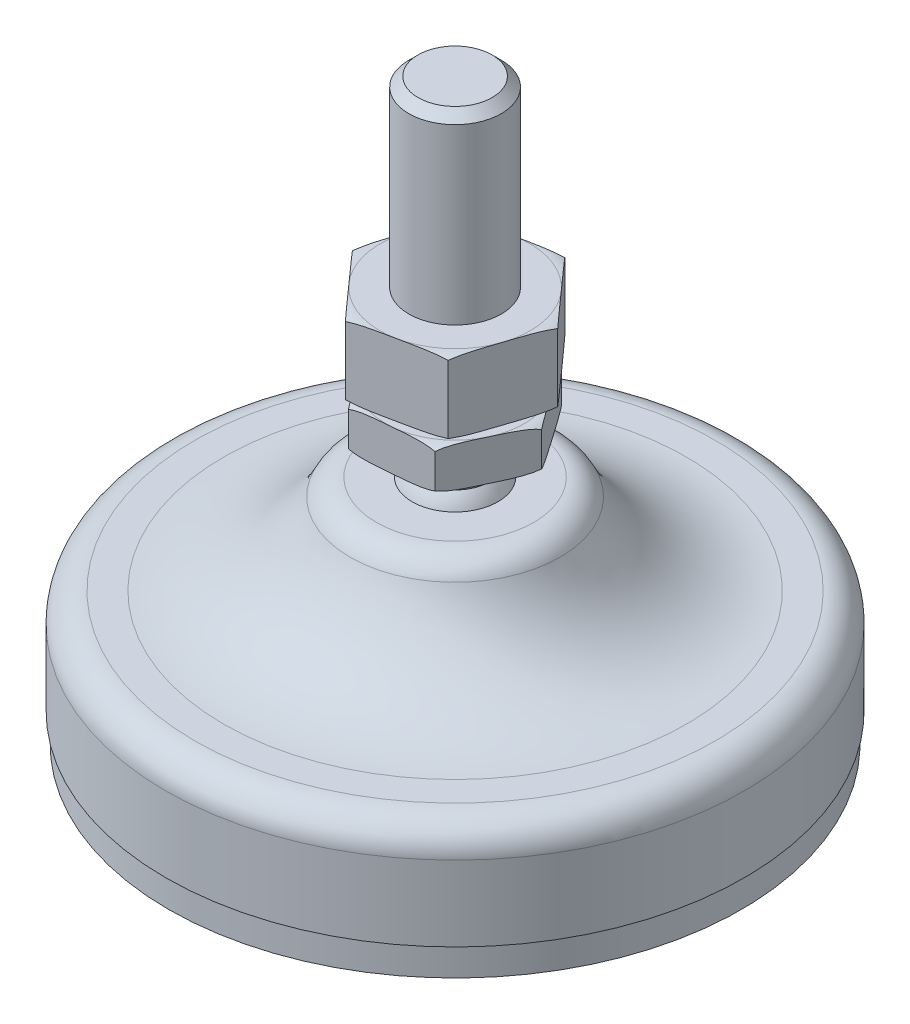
ISO-10303-21;
HEADER;
FILE_DESCRIPTION(('STEP AP214'),'2;1');
FILE_NAME('part.step','',(''),(''),'','','');
FILE_SCHEMA(('AUTOMOTIVE_DESIGN { 1 0 10303 214 1 1 1 1 }'));
ENDSEC;
DATA;
#1=APPLICATION_CONTEXT('core data for automotive mechanical design processes');
#2=APPLICATION_PROTOCOL_DEFINITION('international standard','automotive_design',2000,#1);
#3=PRODUCT_CONTEXT('',#1,'mechanical');
#4=PRODUCT('Part','Part','',(#3));
#5=PRODUCT_RELATED_PRODUCT_CATEGORY('part','',(#4));
#6=PRODUCT_DEFINITION_FORMATION('','',#4);
#7=PRODUCT_DEFINITION_CONTEXT('part definition',#1,'design');
#8=PRODUCT_DEFINITION('design','',#6,#7);
#9=PRODUCT_DEFINITION_SHAPE('','',#8);
#10=(LENGTH_UNIT() NAMED_UNIT(*) SI_UNIT(.MILLI.,.METRE.));
#11=(NAMED_UNIT(*) PLANE_ANGLE_UNIT() SI_UNIT($,.RADIAN.));
#12=(NAMED_UNIT(*) SI_UNIT($,.STERADIAN.) SOLID_ANGLE_UNIT());
#13=UNCERTAINTY_MEASURE_WITH_UNIT(LENGTH_MEASURE(1.E-05),#10,'distance_accuracy_value','');
#14=(GEOMETRIC_REPRESENTATION_CONTEXT(3) GLOBAL_UNCERTAINTY_ASSIGNED_CONTEXT((#13)) GLOBAL_UNIT_ASSIGNED_CONTEXT((#10,
#11,#12)) REPRESENTATION_CONTEXT('',''));
#15=CARTESIAN_POINT('',(0.,0.,0.));
#16=DIRECTION('',(0.,0.,1.));
#17=DIRECTION('',(1.,0.,0.));
#18=AXIS2_PLACEMENT_3D('',#15,#16,#17);
#19=CARTESIAN_POINT('',(0.,-24.75,0.));
#20=DIRECTION('',(0.,1.,0.));
#21=DIRECTION('',(0.,0.,1.));
#22=AXIS2_PLACEMENT_3D('',#19,#20,#21);
#23=TOROIDAL_SURFACE('',#22,6.,1.75);
#24=CARTESIAN_POINT('',(-6.90391613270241,-26.2334869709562,0.580924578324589));
#25=CARTESIAN_POINT('',(-6.86649016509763,-26.2609700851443,0.501360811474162));
#26=CARTESIAN_POINT('',(-6.82867453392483,-26.28529510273,0.420968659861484));
#27=CARTESIAN_POINT('',(-6.7525295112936,-26.3284956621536,0.259092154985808));
#28=CARTESIAN_POINT('',(-6.71420082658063,-26.347378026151,0.177609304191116));
#29=CARTESIAN_POINT('',(-6.63744725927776,-26.380517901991,0.0144390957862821));
#30=CARTESIAN_POINT('',(-6.59902457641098,-26.394804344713,-0.0672435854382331));
#31=CARTESIAN_POINT('',(-6.52195310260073,-26.4196782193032,-0.231089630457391));
#32=CARTESIAN_POINT('',(-6.48330423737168,-26.4302643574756,-0.313253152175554));
#33=CARTESIAN_POINT('',(-6.36758882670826,-26.457425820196,-0.559252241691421));
#34=CARTESIAN_POINT('',(-6.2903360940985,-26.4695677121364,-0.723483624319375));
#35=CARTESIAN_POINT('',(-6.17429724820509,-26.4823380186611,-0.970170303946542));
#36=CARTESIAN_POINT('',(-6.13554952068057,-26.485688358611,-1.05254399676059));
#37=CARTESIAN_POINT('',(-6.05803352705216,-26.4910263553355,-1.217335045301));
#38=CARTESIAN_POINT('',(-6.01926525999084,-26.4930139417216,-1.29975240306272));
#39=CARTESIAN_POINT('',(-5.89618754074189,-26.4978569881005,-1.5614030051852));
#40=CARTESIAN_POINT('',(-5.81186819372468,-26.4989900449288,-1.74065728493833));
#41=CARTESIAN_POINT('',(-5.6432394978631,-26.5000600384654,-2.099144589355));
#42=CARTESIAN_POINT('',(-5.55893014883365,-26.4999970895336,-2.27837761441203));
#43=CARTESIAN_POINT('',(-5.39047539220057,-26.5000023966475,-2.63649514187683));
#44=CARTESIAN_POINT('',(-5.30632998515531,-26.5000703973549,-2.81537964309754));
#45=CARTESIAN_POINT('',(-5.13799591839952,-26.499707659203,-3.17324059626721));
#46=CARTESIAN_POINT('',(-5.05380725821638,-26.4992766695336,-3.35221704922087));
#47=CARTESIAN_POINT('',(-4.88449237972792,-26.4953843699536,-3.71216310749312));
#48=CARTESIAN_POINT('',(-4.79936625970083,-26.49188905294,-3.89313250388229));
#49=CARTESIAN_POINT('',(-4.62931497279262,-26.4775658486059,-4.25464409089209));
#50=CARTESIAN_POINT('',(-4.54438969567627,-26.4667489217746,-4.43518651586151));
#51=CARTESIAN_POINT('',(-4.41712971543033,-26.4406401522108,-4.70572817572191));
#52=CARTESIAN_POINT('',(-4.37461863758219,-26.4302492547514,-4.79610236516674));
#53=CARTESIAN_POINT('',(-4.28983518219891,-26.4052567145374,-4.97634329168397));
#54=CARTESIAN_POINT('',(-4.24756271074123,-26.3906568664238,-5.06621022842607));
#55=CARTESIAN_POINT('',(-4.16316114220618,-26.3561756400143,-5.24563930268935));
#56=CARTESIAN_POINT('',(-4.12103404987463,-26.3362661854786,-5.33519717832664));
#57=CARTESIAN_POINT('',(-4.03736297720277,-26.2900054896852,-5.51307329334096));
#58=CARTESIAN_POINT('',(-3.99581999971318,-26.2636443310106,-5.60138940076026));
#59=CARTESIAN_POINT('',(-3.95473918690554,-26.2334869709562,-5.68872299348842));
#60=B_SPLINE_CURVE_WITH_KNOTS('',3,(#24,#25,#26,#27,#28,#29,#30,#31,#32,#33,#34,#35,#36,#37,#38,
#39,#40,#41,#42,#43,#44,#45,#46,#47,#48,#49,#50,#51,#52,#53,#54,#55,#56,#57,#58,#59),
.UNSPECIFIED.,.F.,.F.,(4,2,2,2,2,2,2,2,2,2,2,2,2,2,2,2,2,4),(0.,0.276208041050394,
0.552068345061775,0.826156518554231,1.10034042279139,1.64573280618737,1.91901362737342,
2.1923085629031,2.78658438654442,3.38080338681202,3.97386489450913,4.56722462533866,
5.16725386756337,5.76638684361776,6.06755271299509,6.36859035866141,6.67125253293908,
6.97438290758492),.UNSPECIFIED.);
#61=CARTESIAN_POINT('',(-5.42932765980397,-26.5,-2.55389920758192));
#62=VERTEX_POINT('',#61);
#63=CARTESIAN_POINT('',(-3.95483326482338,-26.2335561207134,-5.68852299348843));
#64=VERTEX_POINT('',#63);
#65=EDGE_CURVE('E215',#62,#64,#60,.T.);
#66=ORIENTED_EDGE('',*,*,#65,.T.);
#67=CARTESIAN_POINT('',(-3.95503326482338,-26.2334933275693,-5.68850617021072));
#68=CARTESIAN_POINT('',(-3.86741384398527,-26.2609765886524,-5.69587639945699));
#69=CARTESIAN_POINT('',(-3.77888217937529,-26.2853016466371,-5.70332336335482));
#70=CARTESIAN_POINT('',(-3.60061609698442,-26.3285021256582,-5.71831846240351));
#71=CARTESIAN_POINT('',(-3.51088333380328,-26.3473843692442,-5.72586645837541));
#72=CARTESIAN_POINT('',(-3.33119262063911,-26.3805238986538,-5.74098139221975));
#73=CARTESIAN_POINT('',(-3.24123982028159,-26.3948101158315,-5.74854789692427));
#74=CARTESIAN_POINT('',(-3.06080489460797,-26.4196834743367,-5.7637254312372));
#75=CARTESIAN_POINT('',(-2.97032259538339,-26.4302693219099,-5.77133647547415));
#76=CARTESIAN_POINT('',(-2.69941694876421,-26.4574298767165,-5.79412408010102));
#77=CARTESIAN_POINT('',(-2.51855774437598,-26.469571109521,-5.80933730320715));
#78=CARTESIAN_POINT('',(-2.24689498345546,-26.4823405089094,-5.83218859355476));
#79=CARTESIAN_POINT('',(-2.1561812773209,-26.4856905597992,-5.83981910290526));
#80=CARTESIAN_POINT('',(-1.97470578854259,-26.4910280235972,-5.8550841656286));
#81=CARTESIAN_POINT('',(-1.88394400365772,-26.4930153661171,-5.86271871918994));
#82=CARTESIAN_POINT('',(-1.59581073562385,-26.4978575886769,-5.88695544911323));
#83=CARTESIAN_POINT('',(-1.39841609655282,-26.4989903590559,-5.90355957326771));
#84=CARTESIAN_POINT('',(-1.00365022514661,-26.5000600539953,-5.93676585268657));
#85=CARTESIAN_POINT('',(-0.806278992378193,-26.4999970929,-5.95336800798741));
#86=CARTESIAN_POINT('',(-0.411920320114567,-26.5000023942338,-5.98654003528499));
#87=CARTESIAN_POINT('',(-0.214932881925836,-26.5000704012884,-6.00310990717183));
#88=CARTESIAN_POINT('',(0.179143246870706,-26.4997075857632,-6.03625816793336));
#89=CARTESIAN_POINT('',(0.376231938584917,-26.4992765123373,-6.0528365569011));
#90=CARTESIAN_POINT('',(0.772604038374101,-26.4953840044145,-6.0861779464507));
#91=CARTESIAN_POINT('',(0.971887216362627,-26.4918885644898,-6.10294092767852));
#92=CARTESIAN_POINT('',(1.36998313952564,-26.4775652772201,-6.1364273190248));
#93=CARTESIAN_POINT('',(1.56879614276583,-26.4667483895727,-6.15315075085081));
#94=CARTESIAN_POINT('',(1.86671615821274,-26.4406400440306,-6.17821070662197));
#95=CARTESIAN_POINT('',(1.96623606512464,-26.4302493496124,-6.18658196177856));
#96=CARTESIAN_POINT('',(2.16471708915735,-26.4052573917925,-6.20327746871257));
#97=CARTESIAN_POINT('',(2.26367842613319,-26.3906579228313,-6.2116017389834));
#98=CARTESIAN_POINT('',(2.46126545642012,-26.3561776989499,-6.22822204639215));
#99=CARTESIAN_POINT('',(2.55988645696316,-26.336268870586,-6.23651768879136));
#100=CARTESIAN_POINT('',(2.75576343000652,-26.2900097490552,-6.25299415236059));
#101=CARTESIAN_POINT('',(2.85301705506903,-26.2636495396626,-6.26117477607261));
#102=CARTESIAN_POINT('',(2.94918878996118,-26.2334933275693,-6.26926439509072));
#103=B_SPLINE_CURVE_WITH_KNOTS('',3,(#67,#68,#69,#70,#71,#72,#73,#74,#75,#76,#77,#78,#79,#80,
#81,#82,#83,#84,#85,#86,#87,#88,#89,#90,#91,#92,#93,#94,#95,#96,#97,#98,#99,#100,#101,#102),
.UNSPECIFIED.,.F.,.F.,(4,2,2,2,2,2,2,2,2,2,2,2,2,2,2,2,2,4),(0.,0.276214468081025,
0.552081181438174,0.826175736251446,1.10036602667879,1.6457711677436,1.91905837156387,
2.19235969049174,2.78662409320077,3.38083166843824,3.97388177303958,4.56723008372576,
5.16724736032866,5.76636843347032,6.06752832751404,6.36856000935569,6.67121610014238,
6.97434034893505),.UNSPECIFIED.);
#104=CARTESIAN_POINT('',(-0.502922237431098,-26.5,-5.97888528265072));
#105=VERTEX_POINT('',#104);
#106=EDGE_CURVE('E279',#64,#105,#103,.T.);
#107=ORIENTED_EDGE('',*,*,#106,.T.);
#108=CARTESIAN_POINT('',(0.,-26.5,0.));
#109=DIRECTION('',(0.,1.,0.));
#110=DIRECTION('',(0.,0.,1.));
#111=AXIS2_PLACEMENT_3D('',#108,#109,#110);
#112=CIRCLE('',#111,6.);
#113=EDGE_CURVE('E555',#105,#62,#112,.T.);
#114=ORIENTED_EDGE('',*,*,#113,.T.);
#115=EDGE_LOOP('',(#66,#107,#114));
#116=FACE_BOUND('',#115,.T.);
#117=ADVANCED_FACE('F37',(#116),#23,.T.);
#118=CARTESIAN_POINT('',(4.92640542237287,-26.5,-3.4249860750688));
#119=VERTEX_POINT('',#118);
#120=EDGE_CURVE('E580',#119,#105,#112,.T.);
#121=ORIENTED_EDGE('',*,*,#120,.T.);
#122=CARTESIAN_POINT('',(2.94898878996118,-26.2335561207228,-6.26924757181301));
#123=VERTEX_POINT('',#122);
#124=EDGE_CURVE('E263',#105,#123,#103,.T.);
#125=ORIENTED_EDGE('',*,*,#124,.T.);
#126=CARTESIAN_POINT('',(2.94884974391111,-26.2334799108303,-6.26944757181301));
#127=CARTESIAN_POINT('',(2.99903960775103,-26.2609628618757,-6.1972558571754));
#128=CARTESIAN_POINT('',(3.04975203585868,-26.285287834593,-6.12431250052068));
#129=CARTESIAN_POINT('',(3.15186588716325,-26.32848848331,-5.97743475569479));
#130=CARTESIAN_POINT('',(3.20326636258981,-26.347370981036,-5.90350173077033));
#131=CARTESIAN_POINT('',(3.30619633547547,-26.3805112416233,-5.75545009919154));
#132=CARTESIAN_POINT('',(3.3577228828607,-26.3947979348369,-5.681335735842));
#133=CARTESIAN_POINT('',(3.46107921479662,-26.4196723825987,-5.53267084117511));
#134=CARTESIAN_POINT('',(3.51290909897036,-26.4302588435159,-5.4581201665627));
#135=CARTESIAN_POINT('',(3.66808873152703,-26.4574213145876,-5.23491406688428));
#136=CARTESIAN_POINT('',(3.77168818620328,-26.4695639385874,-5.08589947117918));
#137=CARTESIAN_POINT('',(3.92730161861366,-26.4823352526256,-4.86206940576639));
#138=CARTESIAN_POINT('',(3.97926410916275,-26.485685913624,-4.78732799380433));
#139=CARTESIAN_POINT('',(4.08321663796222,-26.491024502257,-4.63780554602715));
#140=CARTESIAN_POINT('',(4.13520667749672,-26.4930123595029,-4.56302450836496));
#141=CARTESIAN_POINT('',(4.30026494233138,-26.497856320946,-4.32560925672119));
#142=CARTESIAN_POINT('',(4.41334644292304,-26.4989896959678,-4.16295594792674));
#143=CARTESIAN_POINT('',(4.63949603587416,-26.5000600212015,-3.83766861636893));
#144=CARTESIAN_POINT('',(4.75256412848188,-26.499997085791,-3.67503459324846));
#145=CARTESIAN_POINT('',(4.97848045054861,-26.5000023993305,-3.35008279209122));
#146=CARTESIAN_POINT('',(5.09132867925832,-26.5000703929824,-3.18776501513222));
#147=CARTESIAN_POINT('',(5.31708314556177,-26.4997077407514,-2.86304602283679));
#148=CARTESIAN_POINT('',(5.42998938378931,-26.499276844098,-2.70064480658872));
#149=CARTESIAN_POINT('',(5.65705931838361,-26.4953847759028,-2.37403368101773));
#150=CARTESIAN_POINT('',(5.77122288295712,-26.4918895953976,-2.20982396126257));
#151=CARTESIAN_POINT('',(5.99928050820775,-26.4775664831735,-1.88179216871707));
#152=CARTESIAN_POINT('',(6.11317471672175,-26.4667495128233,-1.71796988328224));
#153=CARTESIAN_POINT('',(6.28384444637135,-26.4406402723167,-1.47248325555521));
#154=CARTESIAN_POINT('',(6.34085650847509,-26.4302491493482,-1.39047867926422));
#155=CARTESIAN_POINT('',(6.45456049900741,-26.4052559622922,-1.2269299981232));
#156=CARTESIAN_POINT('',(6.51125255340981,-26.3906556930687,-1.1453857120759));
#157=CARTESIAN_POINT('',(6.6244443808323,-26.3561733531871,-0.982573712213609));
#158=CARTESIAN_POINT('',(6.68094146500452,-26.3362632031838,-0.901309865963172));
#159=CARTESIAN_POINT('',(6.7931535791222,-26.2900007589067,-0.739907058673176));
#160=CARTESIAN_POINT('',(6.84886726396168,-26.263638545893,-0.659770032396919));
#161=CARTESIAN_POINT('',(6.90396110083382,-26.2334799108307,-0.580524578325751));
#162=B_SPLINE_CURVE_WITH_KNOTS('',3,(#126,#127,#128,#129,#130,#131,#132,#133,#134,#135,#136,
#137,#138,#139,#140,#141,#142,#143,#144,#145,#146,#147,#148,#149,#150,#151,#152,#153,#154,#155,
#156,#157,#158,#159,#160,#161),.UNSPECIFIED.,.F.,.F.,(4,2,2,2,2,2,2,2,2,2,2,2,2,2,2,2,2,4),(0.,
0.27620090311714,0.552054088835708,0.826135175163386,1.10031198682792,1.64569020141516,
1.91896393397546,2.19225178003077,2.78654028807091,3.38077197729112,3.97384614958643,
4.56721856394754,5.16726109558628,5.76640729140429,6.06757979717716,6.36862406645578,
6.67129299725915,6.97443017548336),.UNSPECIFIED.);
#163=EDGE_CURVE('E575',#123,#119,#162,.T.);
#164=ORIENTED_EDGE('',*,*,#163,.T.);
#165=EDGE_LOOP('',(#121,#125,#164));
#166=FACE_BOUND('',#165,.T.);
#167=ADVANCED_FACE('F441',(#166),#23,.T.);
#168=CARTESIAN_POINT('',(5.42932765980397,-26.5,2.55389920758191));
#169=VERTEX_POINT('',#168);
#170=EDGE_CURVE('E583',#169,#119,#112,.T.);
#171=ORIENTED_EDGE('',*,*,#170,.T.);
#172=CARTESIAN_POINT('',(6.90382205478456,-26.2335561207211,-0.58072457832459));
#173=VERTEX_POINT('',#172);
#174=EDGE_CURVE('E500',#119,#173,#162,.T.);
#175=ORIENTED_EDGE('',*,*,#174,.T.);
#176=CARTESIAN_POINT('',(6.90391613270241,-26.2334869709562,-0.58092457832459));
#177=CARTESIAN_POINT('',(6.86649016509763,-26.2609700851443,-0.501360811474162));
#178=CARTESIAN_POINT('',(6.82867453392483,-26.28529510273,-0.420968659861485));
#179=CARTESIAN_POINT('',(6.7525295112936,-26.3284956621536,-0.259092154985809));
#180=CARTESIAN_POINT('',(6.71420082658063,-26.347378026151,-0.177609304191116));
#181=CARTESIAN_POINT('',(6.63744725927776,-26.380517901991,-0.0144390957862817));
#182=CARTESIAN_POINT('',(6.59902457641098,-26.394804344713,0.0672435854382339));
#183=CARTESIAN_POINT('',(6.52195310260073,-26.4196782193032,0.231089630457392));
#184=CARTESIAN_POINT('',(6.48330423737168,-26.4302643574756,0.313253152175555));
#185=CARTESIAN_POINT('',(6.36758882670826,-26.457425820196,0.559252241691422));
#186=CARTESIAN_POINT('',(6.2903360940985,-26.4695677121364,0.723483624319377));
#187=CARTESIAN_POINT('',(6.17429724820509,-26.4823380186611,0.970170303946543));
#188=CARTESIAN_POINT('',(6.13554952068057,-26.485688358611,1.05254399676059));
#189=CARTESIAN_POINT('',(6.05803352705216,-26.4910263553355,1.217335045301));
#190=CARTESIAN_POINT('',(6.01926525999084,-26.4930139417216,1.29975240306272));
#191=CARTESIAN_POINT('',(5.89618754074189,-26.4978569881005,1.5614030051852));
#192=CARTESIAN_POINT('',(5.81186819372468,-26.4989900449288,1.74065728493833));
#193=CARTESIAN_POINT('',(5.6432394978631,-26.5000600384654,2.099144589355));
#194=CARTESIAN_POINT('',(5.55893014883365,-26.4999970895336,2.27837761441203));
#195=CARTESIAN_POINT('',(5.39047539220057,-26.5000023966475,2.63649514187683));
#196=CARTESIAN_POINT('',(5.30632998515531,-26.5000703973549,2.81537964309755));
#197=CARTESIAN_POINT('',(5.13799591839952,-26.499707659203,3.17324059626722));
#198=CARTESIAN_POINT('',(5.05380725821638,-26.4992766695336,3.35221704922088));
#199=CARTESIAN_POINT('',(4.88449237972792,-26.4953843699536,3.71216310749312));
#200=CARTESIAN_POINT('',(4.79936625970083,-26.49188905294,3.89313250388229));
#201=CARTESIAN_POINT('',(4.62931497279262,-26.4775658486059,4.25464409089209));
#202=CARTESIAN_POINT('',(4.54438969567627,-26.4667489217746,4.43518651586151));
#203=CARTESIAN_POINT('',(4.41712971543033,-26.4406401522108,4.70572817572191));
#204=CARTESIAN_POINT('',(4.37461863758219,-26.4302492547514,4.79610236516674));
#205=CARTESIAN_POINT('',(4.28983518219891,-26.4052567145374,4.97634329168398));
#206=CARTESIAN_POINT('',(4.24756271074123,-26.3906568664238,5.06621022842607));
#207=CARTESIAN_POINT('',(4.16316114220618,-26.3561756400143,5.24563930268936));
#208=CARTESIAN_POINT('',(4.12103404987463,-26.3362661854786,5.33519717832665));
#209=CARTESIAN_POINT('',(4.03736297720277,-26.2900054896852,5.51307329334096));
#210=CARTESIAN_POINT('',(3.99581999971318,-26.2636443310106,5.60138940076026));
#211=CARTESIAN_POINT('',(3.95473918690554,-26.2334869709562,5.68872299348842));
#212=B_SPLINE_CURVE_WITH_KNOTS('',3,(#176,#177,#178,#179,#180,#181,#182,#183,#184,#185,#186,
#187,#188,#189,#190,#191,#192,#193,#194,#195,#196,#197,#198,#199,#200,#201,#202,#203,#204,#205,
#206,#207,#208,#209,#210,#211),.UNSPECIFIED.,.F.,.F.,(4,2,2,2,2,2,2,2,2,2,2,2,2,2,2,2,2,4),(0.,
0.276208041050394,0.552068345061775,0.826156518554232,1.10034042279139,1.64573280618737,
1.91901362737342,2.19230856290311,2.78658438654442,3.38080338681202,3.97386489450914,
4.56722462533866,5.16725386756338,5.76638684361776,6.0675527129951,6.36859035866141,
6.67125253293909,6.97438290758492),.UNSPECIFIED.);
#213=EDGE_CURVE('E568',#173,#169,#212,.T.);
#214=ORIENTED_EDGE('',*,*,#213,.T.);
#215=EDGE_LOOP('',(#171,#175,#214));
#216=FACE_BOUND('',#215,.T.);
#217=ADVANCED_FACE('F584',(#216),#23,.T.);
#218=CARTESIAN_POINT('',(0.502922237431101,-26.5,5.97888528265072));
#219=VERTEX_POINT('',#218);
#220=EDGE_CURVE('E239',#219,#169,#112,.T.);
#221=ORIENTED_EDGE('',*,*,#220,.T.);
#222=CARTESIAN_POINT('',(3.95483326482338,-26.2335561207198,5.68852299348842));
#223=VERTEX_POINT('',#222);
#224=EDGE_CURVE('E486',#169,#223,#212,.T.);
#225=ORIENTED_EDGE('',*,*,#224,.T.);
#226=CARTESIAN_POINT('',(3.95503326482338,-26.2334933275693,5.68850617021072));
#227=CARTESIAN_POINT('',(3.86741384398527,-26.2609765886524,5.69587639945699));
#228=CARTESIAN_POINT('',(3.77888217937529,-26.2853016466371,5.70332336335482));
#229=CARTESIAN_POINT('',(3.60061609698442,-26.3285021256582,5.71831846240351));
#230=CARTESIAN_POINT('',(3.51088333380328,-26.3473843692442,5.72586645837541));
#231=CARTESIAN_POINT('',(3.33119262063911,-26.3805238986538,5.74098139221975));
#232=CARTESIAN_POINT('',(3.2412398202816,-26.3948101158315,5.74854789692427));
#233=CARTESIAN_POINT('',(3.06080489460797,-26.4196834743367,5.7637254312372));
#234=CARTESIAN_POINT('',(2.9703225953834,-26.4302693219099,5.77133647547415));
#235=CARTESIAN_POINT('',(2.69941694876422,-26.4574298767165,5.79412408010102));
#236=CARTESIAN_POINT('',(2.51855774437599,-26.469571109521,5.80933730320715));
#237=CARTESIAN_POINT('',(2.24689498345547,-26.4823405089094,5.83218859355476));
#238=CARTESIAN_POINT('',(2.15618127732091,-26.4856905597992,5.83981910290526));
#239=CARTESIAN_POINT('',(1.9747057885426,-26.4910280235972,5.8550841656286));
#240=CARTESIAN_POINT('',(1.88394400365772,-26.4930153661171,5.86271871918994));
#241=CARTESIAN_POINT('',(1.59581073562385,-26.4978575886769,5.88695544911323));
#242=CARTESIAN_POINT('',(1.39841609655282,-26.4989903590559,5.90355957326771));
#243=CARTESIAN_POINT('',(1.00365022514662,-26.5000600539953,5.93676585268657));
#244=CARTESIAN_POINT('',(0.806278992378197,-26.4999970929,5.95336800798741));
#245=CARTESIAN_POINT('',(0.411920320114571,-26.5000023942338,5.98654003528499));
#246=CARTESIAN_POINT('',(0.214932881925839,-26.5000704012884,6.00310990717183));
#247=CARTESIAN_POINT('',(-0.179143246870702,-26.4997075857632,6.03625816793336));
#248=CARTESIAN_POINT('',(-0.376231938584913,-26.4992765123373,6.0528365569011));
#249=CARTESIAN_POINT('',(-0.772604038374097,-26.4953840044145,6.0861779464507));
#250=CARTESIAN_POINT('',(-0.971887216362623,-26.4918885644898,6.10294092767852));
#251=CARTESIAN_POINT('',(-1.36998313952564,-26.4775652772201,6.1364273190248));
#252=CARTESIAN_POINT('',(-1.56879614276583,-26.4667483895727,6.15315075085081));
#253=CARTESIAN_POINT('',(-1.86671615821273,-26.4406400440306,6.17821070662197));
#254=CARTESIAN_POINT('',(-1.96623606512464,-26.4302493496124,6.18658196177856));
#255=CARTESIAN_POINT('',(-2.16471708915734,-26.4052573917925,6.20327746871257));
#256=CARTESIAN_POINT('',(-2.26367842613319,-26.3906579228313,6.2116017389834));
#257=CARTESIAN_POINT('',(-2.46126545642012,-26.3561776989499,6.22822204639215));
#258=CARTESIAN_POINT('',(-2.55988645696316,-26.336268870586,6.23651768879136));
#259=CARTESIAN_POINT('',(-2.75576343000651,-26.2900097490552,6.25299415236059));
#260=CARTESIAN_POINT('',(-2.85301705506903,-26.2636495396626,6.26117477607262));
#261=CARTESIAN_POINT('',(-2.94918878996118,-26.2334933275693,6.26926439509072));
#262=B_SPLINE_CURVE_WITH_KNOTS('',3,(#226,#227,#228,#229,#230,#231,#232,#233,#234,#235,#236,
#237,#238,#239,#240,#241,#242,#243,#244,#245,#246,#247,#248,#249,#250,#251,#252,#253,#254,#255,
#256,#257,#258,#259,#260,#261),.UNSPECIFIED.,.F.,.F.,(4,2,2,2,2,2,2,2,2,2,2,2,2,2,2,2,2,4),(0.,
0.276214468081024,0.552081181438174,0.826175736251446,1.10036602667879,1.6457711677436,
1.91905837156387,2.19235969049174,2.78662409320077,3.38083166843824,3.97388177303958,
4.56723008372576,5.16724736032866,5.76636843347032,6.06752832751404,6.36856000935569,
6.67121610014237,6.97434034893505),.UNSPECIFIED.);
#263=EDGE_CURVE('E563',#223,#219,#262,.T.);
#264=ORIENTED_EDGE('',*,*,#263,.T.);
#265=EDGE_LOOP('',(#221,#225,#264));
#266=FACE_BOUND('',#265,.T.);
#267=ADVANCED_FACE('F676',(#266),#23,.T.);
#268=CARTESIAN_POINT('',(-4.92640542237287,-26.5,3.4249860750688));
#269=VERTEX_POINT('',#268);
#270=EDGE_CURVE('E249',#269,#219,#112,.T.);
#271=ORIENTED_EDGE('',*,*,#270,.T.);
#272=CARTESIAN_POINT('',(-2.94898878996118,-26.2335561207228,6.26924757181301));
#273=VERTEX_POINT('',#272);
#274=EDGE_CURVE('E480',#219,#273,#262,.T.);
#275=ORIENTED_EDGE('',*,*,#274,.T.);
#276=CARTESIAN_POINT('',(-2.94884974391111,-26.2334799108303,6.26944757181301));
#277=CARTESIAN_POINT('',(-2.99903960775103,-26.2609628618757,6.1972558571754));
#278=CARTESIAN_POINT('',(-3.04975203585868,-26.285287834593,6.12431250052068));
#279=CARTESIAN_POINT('',(-3.15186588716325,-26.32848848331,5.97743475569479));
#280=CARTESIAN_POINT('',(-3.20326636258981,-26.347370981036,5.90350173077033));
#281=CARTESIAN_POINT('',(-3.30619633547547,-26.3805112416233,5.75545009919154));
#282=CARTESIAN_POINT('',(-3.3577228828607,-26.3947979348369,5.681335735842));
#283=CARTESIAN_POINT('',(-3.46107921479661,-26.4196723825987,5.53267084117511));
#284=CARTESIAN_POINT('',(-3.51290909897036,-26.4302588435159,5.4581201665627));
#285=CARTESIAN_POINT('',(-3.66808873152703,-26.4574213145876,5.23491406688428));
#286=CARTESIAN_POINT('',(-3.77168818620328,-26.4695639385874,5.08589947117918));
#287=CARTESIAN_POINT('',(-3.92730161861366,-26.4823352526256,4.86206940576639));
#288=CARTESIAN_POINT('',(-3.97926410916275,-26.485685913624,4.78732799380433));
#289=CARTESIAN_POINT('',(-4.08321663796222,-26.491024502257,4.63780554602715));
#290=CARTESIAN_POINT('',(-4.13520667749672,-26.4930123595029,4.56302450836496));
#291=CARTESIAN_POINT('',(-4.30026494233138,-26.497856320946,4.32560925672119));
#292=CARTESIAN_POINT('',(-4.41334644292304,-26.4989896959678,4.16295594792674));
#293=CARTESIAN_POINT('',(-4.63949603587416,-26.5000600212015,3.83766861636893));
#294=CARTESIAN_POINT('',(-4.75256412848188,-26.499997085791,3.67503459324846));
#295=CARTESIAN_POINT('',(-4.97848045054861,-26.5000023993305,3.35008279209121));
#296=CARTESIAN_POINT('',(-5.09132867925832,-26.5000703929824,3.18776501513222));
#297=CARTESIAN_POINT('',(-5.31708314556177,-26.4997077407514,2.86304602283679));
#298=CARTESIAN_POINT('',(-5.42998938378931,-26.499276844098,2.70064480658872));
#299=CARTESIAN_POINT('',(-5.65705931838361,-26.4953847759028,2.37403368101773));
#300=CARTESIAN_POINT('',(-5.77122288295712,-26.4918895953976,2.20982396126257));
#301=CARTESIAN_POINT('',(-5.99928050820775,-26.4775664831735,1.88179216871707));
#302=CARTESIAN_POINT('',(-6.11317471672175,-26.4667495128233,1.71796988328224));
#303=CARTESIAN_POINT('',(-6.28384444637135,-26.4406402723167,1.47248325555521));
#304=CARTESIAN_POINT('',(-6.34085650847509,-26.4302491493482,1.39047867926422));
#305=CARTESIAN_POINT('',(-6.45456049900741,-26.4052559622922,1.2269299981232));
#306=CARTESIAN_POINT('',(-6.51125255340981,-26.3906556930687,1.1453857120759));
#307=CARTESIAN_POINT('',(-6.6244443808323,-26.3561733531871,0.982573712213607));
#308=CARTESIAN_POINT('',(-6.68094146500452,-26.3362632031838,0.90130986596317));
#309=CARTESIAN_POINT('',(-6.7931535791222,-26.2900007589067,0.739907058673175));
#310=CARTESIAN_POINT('',(-6.84886726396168,-26.263638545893,0.659770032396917));
#311=CARTESIAN_POINT('',(-6.90396110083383,-26.2334799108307,0.580524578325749));
#312=B_SPLINE_CURVE_WITH_KNOTS('',3,(#276,#277,#278,#279,#280,#281,#282,#283,#284,#285,#286,
#287,#288,#289,#290,#291,#292,#293,#294,#295,#296,#297,#298,#299,#300,#301,#302,#303,#304,#305,
#306,#307,#308,#309,#310,#311),.UNSPECIFIED.,.F.,.F.,(4,2,2,2,2,2,2,2,2,2,2,2,2,2,2,2,2,4),(0.,
0.27620090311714,0.552054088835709,0.826135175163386,1.10031198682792,1.64569020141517,
1.91896393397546,2.19225178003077,2.78654028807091,3.38077197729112,3.97384614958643,
4.56721856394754,5.16726109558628,5.76640729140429,6.06757979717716,6.36862406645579,
6.67129299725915,6.97443017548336),.UNSPECIFIED.);
#313=EDGE_CURVE('E537',#273,#269,#312,.T.);
#314=ORIENTED_EDGE('',*,*,#313,.T.);
#315=EDGE_LOOP('',(#271,#275,#314));
#316=FACE_BOUND('',#315,.T.);
#317=ADVANCED_FACE('F669',(#316),#23,.T.);
#318=EDGE_CURVE('E252',#62,#269,#112,.T.);
#319=ORIENTED_EDGE('',*,*,#318,.T.);
#320=CARTESIAN_POINT('',(-6.90382205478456,-26.2335561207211,0.580724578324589));
#321=VERTEX_POINT('',#320);
#322=EDGE_CURVE('E467',#269,#321,#312,.T.);
#323=ORIENTED_EDGE('',*,*,#322,.T.);
#324=EDGE_CURVE('E545',#321,#62,#60,.T.);
#325=ORIENTED_EDGE('',*,*,#324,.T.);
#326=EDGE_LOOP('',(#319,#323,#325));
#327=FACE_BOUND('',#326,.T.);
#328=ADVANCED_FACE('F557',(#327),#23,.T.);
#329=CARTESIAN_POINT('',(0.,-50.,0.));
#330=DIRECTION('',(0.,-1.,0.));
#331=DIRECTION('',(0.,0.,-1.));
#332=AXIS2_PLACEMENT_3D('',#329,#330,#331);
#333=PLANE('',#332);
#334=CARTESIAN_POINT('',(0.,-50.,0.));
#335=DIRECTION('',(0.,1.,0.));
#336=DIRECTION('',(0.,0.,1.));
#337=AXIS2_PLACEMENT_3D('',#334,#335,#336);
#338=CIRCLE('',#337,24.75);
#339=CARTESIAN_POINT('',(0.,-50.,24.75));
#340=VERTEX_POINT('',#339);
#341=EDGE_CURVE('E11',#340,#340,#338,.T.);
#342=ORIENTED_EDGE('',*,*,#341,.F.);
#343=EDGE_LOOP('',(#342));
#344=FACE_BOUND('',#343,.T.);
#345=ADVANCED_FACE('F668',(#344),#333,.T.);
#346=CARTESIAN_POINT('',(0.,0.,0.));
#347=DIRECTION('',(0.,1.,0.));
#348=DIRECTION('',(0.,0.,1.));
#349=AXIS2_PLACEMENT_3D('',#346,#347,#348);
#350=CYLINDRICAL_SURFACE('',#349,24.75);
#351=ORIENTED_EDGE('',*,*,#341,.T.);
#352=EDGE_LOOP('',(#351));
#353=FACE_BOUND('',#352,.T.);
#354=CARTESIAN_POINT('',(0.,-47.5,0.));
#355=DIRECTION('',(0.,1.,0.));
#356=DIRECTION('',(0.,0.,1.));
#357=AXIS2_PLACEMENT_3D('',#354,#355,#356);
#358=CIRCLE('',#357,24.75);
#359=CARTESIAN_POINT('',(0.,-47.5,24.75));
#360=VERTEX_POINT('',#359);
#361=EDGE_CURVE('E47',#360,#360,#358,.T.);
#362=ORIENTED_EDGE('',*,*,#361,.F.);
#363=EDGE_LOOP('',(#362));
#364=FACE_BOUND('',#363,.T.);
#365=ADVANCED_FACE('F674',(#353,#364),#350,.T.);
#366=CARTESIAN_POINT('',(-24.75,-47.5,0.));
#367=DIRECTION('',(0.,-1.,0.));
#368=DIRECTION('',(0.,0.,-1.));
#369=AXIS2_PLACEMENT_3D('',#366,#367,#368);
#370=PLANE('',#369);
#371=ORIENTED_EDGE('',*,*,#361,.T.);
#372=EDGE_LOOP('',(#371));
#373=FACE_BOUND('',#372,.T.);
#374=CARTESIAN_POINT('',(0.,-47.5,0.));
#375=DIRECTION('',(0.,1.,0.));
#376=DIRECTION('',(0.,0.,1.));
#377=AXIS2_PLACEMENT_3D('',#374,#375,#376);
#378=CIRCLE('',#377,25.);
#379=CARTESIAN_POINT('',(0.,-47.5,25.));
#380=VERTEX_POINT('',#379);
#381=EDGE_CURVE('E611',#380,#380,#378,.T.);
#382=ORIENTED_EDGE('',*,*,#381,.F.);
#383=EDGE_LOOP('',(#382));
#384=FACE_BOUND('',#383,.T.);
#385=ADVANCED_FACE('F974',(#373,#384),#370,.T.);
#386=CARTESIAN_POINT('',(0.,0.,0.));
#387=DIRECTION('',(0.,1.,0.));
#388=DIRECTION('',(0.,0.,1.));
#389=AXIS2_PLACEMENT_3D('',#386,#387,#388);
#390=CYLINDRICAL_SURFACE('',#389,25.);
#391=ORIENTED_EDGE('',*,*,#381,.T.);
#392=EDGE_LOOP('',(#391));
#393=FACE_BOUND('',#392,.T.);
#394=CARTESIAN_POINT('',(0.,-41.,0.));
#395=DIRECTION('',(0.,1.,0.));
#396=DIRECTION('',(0.,0.,1.));
#397=AXIS2_PLACEMENT_3D('',#394,#395,#396);
#398=CIRCLE('',#397,25.);
#399=CARTESIAN_POINT('',(0.,-41.,25.));
#400=VERTEX_POINT('',#399);
#401=EDGE_CURVE('E608',#400,#400,#398,.T.);
#402=ORIENTED_EDGE('',*,*,#401,.F.);
#403=EDGE_LOOP('',(#402));
#404=FACE_BOUND('',#403,.T.);
#405=ADVANCED_FACE('F963',(#393,#404),#390,.T.);
#406=CARTESIAN_POINT('',(0.,-41.,0.));
#407=DIRECTION('',(0.,1.,0.));
#408=DIRECTION('',(0.,0.,1.));
#409=AXIS2_PLACEMENT_3D('',#406,#407,#408);
#410=TOROIDAL_SURFACE('',#409,22.5,2.5);
#411=ORIENTED_EDGE('',*,*,#401,.T.);
#412=EDGE_LOOP('',(#411));
#413=FACE_BOUND('',#412,.T.);
#414=CARTESIAN_POINT('',(0.,-38.5,0.));
#415=DIRECTION('',(0.,1.,0.));
#416=DIRECTION('',(0.,0.,1.));
#417=AXIS2_PLACEMENT_3D('',#414,#415,#416);
#418=CIRCLE('',#417,22.5);
#419=CARTESIAN_POINT('',(0.,-38.5,22.5));
#420=VERTEX_POINT('',#419);
#421=EDGE_CURVE('E605',#420,#420,#418,.T.);
#422=ORIENTED_EDGE('',*,*,#421,.F.);
#423=EDGE_LOOP('',(#422));
#424=FACE_BOUND('',#423,.T.);
#425=ADVANCED_FACE('F952',(#413,#424),#410,.T.);
#426=CARTESIAN_POINT('',(-22.5,-38.5,0.));
#427=DIRECTION('',(0.,1.,0.));
#428=DIRECTION('',(0.,0.,1.));
#429=AXIS2_PLACEMENT_3D('',#426,#427,#428);
#430=PLANE('',#429);
#431=ORIENTED_EDGE('',*,*,#421,.T.);
#432=EDGE_LOOP('',(#431));
#433=FACE_BOUND('',#432,.T.);
#434=CARTESIAN_POINT('',(0.,-38.5,0.));
#435=DIRECTION('',(0.,1.,0.));
#436=DIRECTION('',(0.,0.,1.));
#437=AXIS2_PLACEMENT_3D('',#434,#435,#436);
#438=CIRCLE('',#437,20.);
#439=CARTESIAN_POINT('',(0.,-38.5,20.));
#440=VERTEX_POINT('',#439);
#441=EDGE_CURVE('E602',#440,#440,#438,.T.);
#442=ORIENTED_EDGE('',*,*,#441,.F.);
#443=EDGE_LOOP('',(#442));
#444=FACE_BOUND('',#443,.T.);
#445=ADVANCED_FACE('F941',(#433,#444),#430,.T.);
#446=CARTESIAN_POINT('',(0.,-26.5,0.));
#447=DIRECTION('',(0.,1.,0.));
#448=DIRECTION('',(0.,0.,1.));
#449=AXIS2_PLACEMENT_3D('',#446,#447,#448);
#450=TOROIDAL_SURFACE('',#449,20.,12.);
#451=ORIENTED_EDGE('',*,*,#441,.T.);
#452=EDGE_LOOP('',(#451));
#453=FACE_BOUND('',#452,.T.);
#454=CARTESIAN_POINT('',(0.,-31.4655172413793,0.));
#455=DIRECTION('',(0.,1.,0.));
#456=DIRECTION('',(0.,0.,1.));
#457=AXIS2_PLACEMENT_3D('',#454,#455,#456);
#458=CIRCLE('',#457,9.07554859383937);
#459=CARTESIAN_POINT('',(0.,-31.4655172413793,9.07554859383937));
#460=VERTEX_POINT('',#459);
#461=EDGE_CURVE('E599',#460,#460,#458,.T.);
#462=ORIENTED_EDGE('',*,*,#461,.F.);
#463=EDGE_LOOP('',(#462));
#464=FACE_BOUND('',#463,.T.);
#465=ADVANCED_FACE('F930',(#453,#464),#450,.F.);
#466=CARTESIAN_POINT('',(0.,-32.5,0.));
#467=DIRECTION('',(0.,1.,0.));
#468=DIRECTION('',(0.,0.,1.));
#469=AXIS2_PLACEMENT_3D('',#466,#467,#468);
#470=TOROIDAL_SURFACE('',#469,6.7996212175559,2.5);
#471=ORIENTED_EDGE('',*,*,#461,.T.);
#472=EDGE_LOOP('',(#471));
#473=FACE_BOUND('',#472,.T.);
#474=CARTESIAN_POINT('',(0.,-30.,0.));
#475=DIRECTION('',(0.,1.,0.));
#476=DIRECTION('',(0.,0.,1.));
#477=AXIS2_PLACEMENT_3D('',#474,#475,#476);
#478=CIRCLE('',#477,6.7996212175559);
#479=CARTESIAN_POINT('',(0.,-30.,6.7996212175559));
#480=VERTEX_POINT('',#479);
#481=EDGE_CURVE('E596',#480,#480,#478,.T.);
#482=ORIENTED_EDGE('',*,*,#481,.F.);
#483=EDGE_LOOP('',(#482));
#484=FACE_BOUND('',#483,.T.);
#485=ADVANCED_FACE('F919',(#473,#484),#470,.T.);
#486=CARTESIAN_POINT('',(-6.7996212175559,-30.,0.));
#487=DIRECTION('',(0.,1.,0.));
#488=DIRECTION('',(0.,0.,1.));
#489=AXIS2_PLACEMENT_3D('',#486,#487,#488);
#490=PLANE('',#489);
#491=ORIENTED_EDGE('',*,*,#481,.T.);
#492=EDGE_LOOP('',(#491));
#493=FACE_BOUND('',#492,.T.);
#494=CARTESIAN_POINT('',(0.,-30.,0.));
#495=DIRECTION('',(0.,1.,0.));
#496=DIRECTION('',(0.,0.,1.));
#497=AXIS2_PLACEMENT_3D('',#494,#495,#496);
#498=CIRCLE('',#497,3.70809924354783);
#499=CARTESIAN_POINT('',(-3.70809924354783,-30.,0.));
#500=VERTEX_POINT('',#499);
#501=EDGE_CURVE('E591',#500,#500,#498,.T.);
#502=ORIENTED_EDGE('',*,*,#501,.F.);
#503=EDGE_LOOP('',(#502));
#504=FACE_BOUND('',#503,.T.);
#505=ADVANCED_FACE('F908',(#493,#504),#490,.T.);
#506=CARTESIAN_POINT('',(0.,-31.5,0.));
#507=DIRECTION('',(0.,1.,0.));
#508=DIRECTION('',(-1.,0.,0.));
#509=AXIS2_PLACEMENT_3D('',#506,#507,#508);
#510=SPHERICAL_SURFACE('',#509,4.);
#511=CARTESIAN_POINT('',(0.,-28.8542486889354,0.));
#512=DIRECTION('',(0.,1.,0.));
#513=DIRECTION('',(0.,0.,1.));
#514=AXIS2_PLACEMENT_3D('',#511,#512,#513);
#515=CIRCLE('',#514,2.99999999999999);
#516=CARTESIAN_POINT('',(-2.99999999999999,-28.8542486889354,0.));
#517=VERTEX_POINT('',#516);
#518=EDGE_CURVE('E587',#517,#517,#515,.T.);
#519=CARTESIAN_POINT('',(-3.70809924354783,-30.,0.));
#520=CARTESIAN_POINT('',(-3.70281272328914,-29.9869313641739,0.));
#521=CARTESIAN_POINT('',(-3.69745710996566,-29.9738906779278,0.));
#522=CARTESIAN_POINT('',(-3.68660830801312,-29.9478666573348,0.));
#523=CARTESIAN_POINT('',(-3.68111511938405,-29.9348833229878,0.));
#524=CARTESIAN_POINT('',(-3.66999177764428,-29.9089754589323,0.));
#525=CARTESIAN_POINT('',(-3.66436162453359,-29.8960509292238,0.));
#526=CARTESIAN_POINT('',(-3.65296498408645,-29.8702621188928,0.));
#527=CARTESIAN_POINT('',(-3.64719849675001,-29.8573978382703,0.));
#528=CARTESIAN_POINT('',(-3.63552983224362,-29.8317309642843,0.));
#529=CARTESIAN_POINT('',(-3.62962765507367,-29.8189283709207,0.));
#530=CARTESIAN_POINT('',(-3.61768827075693,-29.7933863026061,0.));
#531=CARTESIAN_POINT('',(-3.61165106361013,-29.780646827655,0.));
#532=CARTESIAN_POINT('',(-3.59944229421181,-29.7552324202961,0.));
#533=CARTESIAN_POINT('',(-3.5932707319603,-29.7425574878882,0.));
#534=CARTESIAN_POINT('',(-3.58079394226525,-29.7172735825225,0.));
#535=CARTESIAN_POINT('',(-3.57448871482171,-29.7046646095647,0.));
#536=CARTESIAN_POINT('',(-3.56174529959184,-29.6795140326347,0.));
#537=CARTESIAN_POINT('',(-3.5553071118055,-29.6669724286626,0.));
#538=CARTESIAN_POINT('',(-3.54229849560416,-29.6419579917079,0.));
#539=CARTESIAN_POINT('',(-3.53572806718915,-29.6294851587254,0.));
#540=CARTESIAN_POINT('',(-3.52245570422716,-29.6046096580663,0.));
#541=CARTESIAN_POINT('',(-3.51575376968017,-29.5922069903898,0.));
#542=CARTESIAN_POINT('',(-3.50221914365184,-29.5674732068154,0.));
#543=CARTESIAN_POINT('',(-3.49538645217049,-29.5551420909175,0.));
#544=CARTESIAN_POINT('',(-3.48159107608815,-29.5305527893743,0.));
#545=CARTESIAN_POINT('',(-3.47462839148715,-29.5182946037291,0.));
#546=CARTESIAN_POINT('',(-3.4605738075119,-29.4938525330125,0.));
#547=CARTESIAN_POINT('',(-3.45348190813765,-29.4816686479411,0.));
#548=CARTESIAN_POINT('',(-3.43916968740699,-29.4573765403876,0.));
#549=CARTESIAN_POINT('',(-3.43194936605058,-29.4452683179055,0.));
#550=CARTESIAN_POINT('',(-3.41738110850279,-29.4211288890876,0.));
#551=CARTESIAN_POINT('',(-3.4100331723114,-29.4090976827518,0.));
#552=CARTESIAN_POINT('',(-3.39521050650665,-29.3851136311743,0.));
#553=CARTESIAN_POINT('',(-3.38773577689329,-29.3731607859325,0.));
#554=CARTESIAN_POINT('',(-3.37266035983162,-29.3493347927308,0.));
#555=CARTESIAN_POINT('',(-3.36505967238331,-29.3374616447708,0.));
#556=CARTESIAN_POINT('',(-3.34973318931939,-29.3137963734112,0.));
#557=CARTESIAN_POINT('',(-3.34200739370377,-29.3020042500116,0.));
#558=CARTESIAN_POINT('',(-3.32643155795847,-29.2785023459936,0.));
#559=CARTESIAN_POINT('',(-3.31858151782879,-29.2667925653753,0.));
#560=CARTESIAN_POINT('',(-3.30275807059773,-29.243456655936,0.));
#561=CARTESIAN_POINT('',(-3.29478466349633,-29.231830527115,0.));
#562=CARTESIAN_POINT('',(-3.27871537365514,-29.2086632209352,0.));
#563=CARTESIAN_POINT('',(-3.27061949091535,-29.1971220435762,0.));
#564=CARTESIAN_POINT('',(-3.254306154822,-29.1741259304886,0.));
#565=CARTESIAN_POINT('',(-3.24608870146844,-29.1626709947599,0.));
#566=CARTESIAN_POINT('',(-3.22953314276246,-29.13984864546,0.));
#567=CARTESIAN_POINT('',(-3.22119503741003,-29.1284812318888,0.));
#568=CARTESIAN_POINT('',(-3.20439910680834,-29.1058351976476,0.));
#569=CARTESIAN_POINT('',(-3.19594128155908,-29.0945565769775,0.));
#570=CARTESIAN_POINT('',(-3.17890685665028,-29.0720893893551,0.));
#571=CARTESIAN_POINT('',(-3.17033025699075,-29.0609008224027,0.));
#572=CARTESIAN_POINT('',(-3.15305924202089,-29.0386149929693,0.));
#573=CARTESIAN_POINT('',(-3.14436482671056,-29.0275177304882,0.));
#574=CARTESIAN_POINT('',(-3.12685915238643,-29.0054157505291,0.));
#575=CARTESIAN_POINT('',(-3.11804789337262,-28.9944110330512,0.));
#576=CARTESIAN_POINT('',(-3.10030951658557,-28.9724953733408,0.));
#577=CARTESIAN_POINT('',(-3.09138239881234,-28.9615844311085,0.));
#578=CARTESIAN_POINT('',(-3.07341330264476,-28.9398575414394,0.));
#579=CARTESIAN_POINT('',(-3.06437132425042,-28.9290415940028,0.));
#580=CARTESIAN_POINT('',(-3.04617351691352,-28.9075059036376,0.));
#581=CARTESIAN_POINT('',(-3.03701768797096,-28.896786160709,0.));
#582=CARTESIAN_POINT('',(-3.01859320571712,-28.8754440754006,0.));
#583=CARTESIAN_POINT('',(-3.00932455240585,-28.8648217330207,0.));
#584=CARTESIAN_POINT('',(-2.99999999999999,-28.8542486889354,0.));
#585=B_SPLINE_CURVE_WITH_KNOTS('',3,(#519,#520,#521,#522,#523,#524,#525,#526,#527,#528,#529,
#530,#531,#532,#533,#534,#535,#536,#537,#538,#539,#540,#541,#542,#543,#544,#545,#546,#547,#548,
#549,#550,#551,#552,#553,#554,#555,#556,#557,#558,#559,#560,#561,#562,#563,#564,#565,#566,#567,
#568,#569,#570,#571,#572,#573,#574,#575,#576,#577,#578,#579,#580,#581,#582,#583,#584),
.UNSPECIFIED.,.F.,.F.,(4,2,2,2,2,2,2,2,2,2,2,2,2,2,2,2,2,2,2,2,2,2,2,2,2,2,2,2,2,2,2,2,4),(0.,
0.0422919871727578,0.0845839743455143,0.126875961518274,0.16916794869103,0.211459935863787,
0.253751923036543,0.296043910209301,0.338335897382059,0.380627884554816,0.422919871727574,
0.465211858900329,0.507503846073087,0.549795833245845,0.592087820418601,0.63437980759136,
0.676671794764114,0.718963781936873,0.761255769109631,0.803547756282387,0.845839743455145,
0.888131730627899,0.93042371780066,0.972715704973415,1.01500769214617,1.05729967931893,
1.09959166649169,1.14188365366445,1.1841756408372,1.22646762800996,1.26875961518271,
1.31105160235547,1.35334358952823),.UNSPECIFIED.);
#586=EDGE_CURVE('BSEAM897',#500,#517,#585,.T.);
#587=ORIENTED_EDGE('',*,*,#501,.T.);
#588=ORIENTED_EDGE('',*,*,#518,.F.);
#589=ORIENTED_EDGE('',*,*,#586,.T.);
#590=ORIENTED_EDGE('',*,*,#586,.F.);
#591=EDGE_LOOP('',(#587,#589,#588,#590));
#592=FACE_BOUND('',#591,.T.);
#593=ADVANCED_FACE('F897',(#592),#510,.T.);
#594=CARTESIAN_POINT('',(0.,0.,0.));
#595=DIRECTION('',(0.,1.,0.));
#596=DIRECTION('',(0.,0.,1.));
#597=AXIS2_PLACEMENT_3D('',#594,#595,#596);
#598=CYLINDRICAL_SURFACE('',#597,2.99999999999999);
#599=ORIENTED_EDGE('',*,*,#518,.T.);
#600=EDGE_LOOP('',(#599));
#601=FACE_BOUND('',#600,.T.);
#602=CARTESIAN_POINT('',(0.,-26.5,0.));
#603=DIRECTION('',(0.,1.,0.));
#604=DIRECTION('',(0.,0.,1.));
#605=AXIS2_PLACEMENT_3D('',#602,#603,#604);
#606=CIRCLE('',#605,2.99999999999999);
#607=CARTESIAN_POINT('',(0.,-26.5,2.99999999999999));
#608=VERTEX_POINT('',#607);
#609=EDGE_CURVE('E585',#608,#608,#606,.T.);
#610=ORIENTED_EDGE('',*,*,#609,.F.);
#611=EDGE_LOOP('',(#610));
#612=FACE_BOUND('',#611,.T.);
#613=ADVANCED_FACE('F892',(#601,#612),#598,.T.);
#614=CARTESIAN_POINT('',(-2.99999999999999,-26.5,0.));
#615=DIRECTION('',(0.,-1.,0.));
#616=DIRECTION('',(0.,0.,-1.));
#617=AXIS2_PLACEMENT_3D('',#614,#615,#616);
#618=PLANE('',#617);
#619=ORIENTED_EDGE('',*,*,#609,.T.);
#620=EDGE_LOOP('',(#619));
#621=FACE_BOUND('',#620,.T.);
#622=ORIENTED_EDGE('',*,*,#220,.F.);
#623=ORIENTED_EDGE('',*,*,#270,.F.);
#624=ORIENTED_EDGE('',*,*,#318,.F.);
#625=ORIENTED_EDGE('',*,*,#113,.F.);
#626=ORIENTED_EDGE('',*,*,#120,.F.);
#627=ORIENTED_EDGE('',*,*,#170,.F.);
#628=EDGE_LOOP('',(#622,#623,#624,#625,#626,#627));
#629=FACE_BOUND('',#628,.T.);
#630=ADVANCED_FACE('F427',(#621,#629),#618,.T.);
#631=CARTESIAN_POINT('',(2.94898878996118,-27.,-6.26924757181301));
#632=DIRECTION('',(-0.0838203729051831,0.,-0.996480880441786));
#633=DIRECTION('',(-0.996480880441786,0.,0.0838203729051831));
#634=AXIS2_PLACEMENT_3D('',#631,#632,#633);
#635=PLANE('',#634);
#636=DIRECTION('',(0.,1.,0.));
#637=VECTOR('',#636,1.);
#638=CARTESIAN_POINT('',(2.94898878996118,-27.,-6.26924757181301));
#639=LINE('',#638,#637);
#640=CARTESIAN_POINT('',(2.94898878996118,-23.2664438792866,-6.26924757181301));
#641=VERTEX_POINT('',#640);
#642=EDGE_CURVE('E205',#123,#641,#639,.T.);
#643=ORIENTED_EDGE('',*,*,#642,.F.);
#644=ORIENTED_EDGE('',*,*,#124,.F.);
#645=ORIENTED_EDGE('',*,*,#106,.F.);
#646=DIRECTION('',(0.,1.,0.));
#647=VECTOR('',#646,1.);
#648=CARTESIAN_POINT('',(-3.95483326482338,-27.,-5.68852299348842));
#649=LINE('',#648,#647);
#650=CARTESIAN_POINT('',(-3.95483326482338,-23.2664438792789,-5.68852299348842));
#651=VERTEX_POINT('',#650);
#652=EDGE_CURVE('E55',#64,#651,#649,.T.);
#653=ORIENTED_EDGE('',*,*,#652,.T.);
#654=CARTESIAN_POINT('',(2.94918878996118,-23.2665066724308,-6.26926439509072));
#655=CARTESIAN_POINT('',(2.86156936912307,-23.2390234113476,-6.26189416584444));
#656=CARTESIAN_POINT('',(2.77303770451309,-23.2146983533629,-6.25444720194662));
#657=CARTESIAN_POINT('',(2.59477162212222,-23.1714978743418,-6.23945210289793));
#658=CARTESIAN_POINT('',(2.50503885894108,-23.1526156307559,-6.23190410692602));
#659=CARTESIAN_POINT('',(2.32534814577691,-23.1194761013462,-6.21678917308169));
#660=CARTESIAN_POINT('',(2.23539534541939,-23.1051898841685,-6.20922266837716));
#661=CARTESIAN_POINT('',(2.05496041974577,-23.0803165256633,-6.19404513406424));
#662=CARTESIAN_POINT('',(1.96447812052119,-23.0697306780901,-6.18643408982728));
#663=CARTESIAN_POINT('',(1.69357247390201,-23.0425701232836,-6.16364648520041));
#664=CARTESIAN_POINT('',(1.51271326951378,-23.030428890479,-6.14843326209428));
#665=CARTESIAN_POINT('',(1.24105050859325,-23.0176594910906,-6.12558197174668));
#666=CARTESIAN_POINT('',(1.15033680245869,-23.0143094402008,-6.11795146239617));
#667=CARTESIAN_POINT('',(0.968861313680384,-23.0089719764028,-6.10268639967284));
#668=CARTESIAN_POINT('',(0.878099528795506,-23.006984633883,-6.09505184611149));
#669=CARTESIAN_POINT('',(0.589966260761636,-23.0021424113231,-6.0708151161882));
#670=CARTESIAN_POINT('',(0.392571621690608,-23.0010096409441,-6.05421099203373));
#671=CARTESIAN_POINT('',(-0.00219424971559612,-22.9999399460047,-6.02100471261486));
#672=CARTESIAN_POINT('',(-0.199565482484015,-23.0000029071,-6.00440255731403));
#673=CARTESIAN_POINT('',(-0.593924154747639,-22.9999976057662,-5.97123053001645));
#674=CARTESIAN_POINT('',(-0.79091159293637,-22.9999295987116,-5.9546606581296));
#675=CARTESIAN_POINT('',(-1.18498772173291,-23.0002924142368,-5.92151239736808));
#676=CARTESIAN_POINT('',(-1.38207641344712,-23.0007234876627,-5.90493400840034));
#677=CARTESIAN_POINT('',(-1.7784485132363,-23.0046159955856,-5.87159261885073));
#678=CARTESIAN_POINT('',(-1.97773169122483,-23.0081114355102,-5.85482963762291));
#679=CARTESIAN_POINT('',(-2.37582761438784,-23.0224347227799,-5.82134324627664));
#680=CARTESIAN_POINT('',(-2.57464061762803,-23.0332516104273,-5.80461981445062));
#681=CARTESIAN_POINT('',(-2.87256063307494,-23.0593599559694,-5.77955985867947));
#682=CARTESIAN_POINT('',(-2.97208053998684,-23.0697506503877,-5.77118860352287));
#683=CARTESIAN_POINT('',(-3.17056156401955,-23.0947426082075,-5.75449309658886));
#684=CARTESIAN_POINT('',(-3.26952290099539,-23.1093420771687,-5.74616882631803));
#685=CARTESIAN_POINT('',(-3.46710993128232,-23.1438223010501,-5.72954851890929));
#686=CARTESIAN_POINT('',(-3.56573093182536,-23.163731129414,-5.72125287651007));
#687=CARTESIAN_POINT('',(-3.76160790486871,-23.2099902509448,-5.70477641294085));
#688=CARTESIAN_POINT('',(-3.85886152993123,-23.2363504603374,-5.69659578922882));
#689=CARTESIAN_POINT('',(-3.95503326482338,-23.2665066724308,-5.68850617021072));
#690=B_SPLINE_CURVE_WITH_KNOTS('',3,(#654,#655,#656,#657,#658,#659,#660,#661,#662,#663,#664,
#665,#666,#667,#668,#669,#670,#671,#672,#673,#674,#675,#676,#677,#678,#679,#680,#681,#682,#683,
#684,#685,#686,#687,#688,#689),.UNSPECIFIED.,.F.,.F.,(4,2,2,2,2,2,2,2,2,2,2,2,2,2,2,2,2,4),(0.,
0.276214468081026,0.552081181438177,0.826175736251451,1.1003660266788,1.64577116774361,
1.91905837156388,2.19235969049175,2.78662409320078,3.38083166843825,3.97388177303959,
4.56723008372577,5.16724736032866,5.76636843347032,6.06752832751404,6.36856000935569,
6.67121610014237,6.97434034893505),.UNSPECIFIED.);
#691=CARTESIAN_POINT('',(-0.50292724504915,-23.,-5.97888486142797));
#692=VERTEX_POINT('',#691);
#693=EDGE_CURVE('E214',#692,#651,#690,.T.);
#694=ORIENTED_EDGE('',*,*,#693,.F.);
#695=EDGE_CURVE('E270',#641,#692,#690,.T.);
#696=ORIENTED_EDGE('',*,*,#695,.F.);
#697=EDGE_LOOP('',(#643,#644,#645,#653,#694,#696));
#698=FACE_BOUND('',#697,.T.);
#699=ADVANCED_FACE('F421',(#698),#635,.T.);
#700=CARTESIAN_POINT('',(6.90382205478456,-27.,-0.58072457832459));
#701=DIRECTION('',(0.821067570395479,0.,-0.570831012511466));
#702=DIRECTION('',(-0.570831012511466,0.,-0.821067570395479));
#703=AXIS2_PLACEMENT_3D('',#700,#701,#702);
#704=PLANE('',#703);
#705=DIRECTION('',(0.,1.,0.));
#706=VECTOR('',#705,1.);
#707=CARTESIAN_POINT('',(6.90382205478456,-27.,-0.58072457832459));
#708=LINE('',#707,#706);
#709=CARTESIAN_POINT('',(6.90382205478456,-23.2664438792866,-0.58072457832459));
#710=VERTEX_POINT('',#709);
#711=EDGE_CURVE('E1204',#173,#710,#708,.T.);
#712=ORIENTED_EDGE('',*,*,#711,.F.);
#713=ORIENTED_EDGE('',*,*,#174,.F.);
#714=ORIENTED_EDGE('',*,*,#163,.F.);
#715=ORIENTED_EDGE('',*,*,#642,.T.);
#716=CARTESIAN_POINT('',(6.90396110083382,-23.2665200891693,-0.580524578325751));
#717=CARTESIAN_POINT('',(6.85377123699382,-23.2390371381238,-0.652716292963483));
#718=CARTESIAN_POINT('',(6.80305880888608,-23.2147121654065,-0.725659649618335));
#719=CARTESIAN_POINT('',(6.70094495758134,-23.1715115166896,-0.872537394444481));
#720=CARTESIAN_POINT('',(6.64954448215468,-23.1526290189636,-0.946470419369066));
#721=CARTESIAN_POINT('',(6.54661450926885,-23.1194887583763,-1.09452205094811));
#722=CARTESIAN_POINT('',(6.49508796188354,-23.1052020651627,-1.16863641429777));
#723=CARTESIAN_POINT('',(6.39173162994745,-23.0803276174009,-1.31730130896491));
#724=CARTESIAN_POINT('',(6.33990174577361,-23.0697411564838,-1.39185198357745));
#725=CARTESIAN_POINT('',(6.18472211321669,-23.0425786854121,-1.61505808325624));
#726=CARTESIAN_POINT('',(6.08112265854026,-23.0304360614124,-1.76407267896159));
#727=CARTESIAN_POINT('',(5.92550922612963,-23.0176647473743,-1.98790274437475));
#728=CARTESIAN_POINT('',(5.87354673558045,-23.0143140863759,-2.06264415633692));
#729=CARTESIAN_POINT('',(5.76959420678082,-23.0089754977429,-2.21216660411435));
#730=CARTESIAN_POINT('',(5.71760416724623,-23.006987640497,-2.28694764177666));
#731=CARTESIAN_POINT('',(5.55254590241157,-23.0021436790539,-2.52436289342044));
#732=CARTESIAN_POINT('',(5.43946440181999,-23.0010103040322,-2.68701620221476));
#733=CARTESIAN_POINT('',(5.21331480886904,-22.9999399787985,-3.01230353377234));
#734=CARTESIAN_POINT('',(5.1002467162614,-23.000002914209,-3.17493755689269));
#735=CARTESIAN_POINT('',(4.87433039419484,-22.9999976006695,-3.49988935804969));
#736=CARTESIAN_POINT('',(4.76148216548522,-22.9999296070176,-3.66220713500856));
#737=CARTESIAN_POINT('',(4.53572769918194,-23.0002922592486,-3.98692612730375));
#738=CARTESIAN_POINT('',(4.42282146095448,-23.000723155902,-4.14932734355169));
#739=CARTESIAN_POINT('',(4.19575152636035,-23.0046152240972,-4.47593846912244));
#740=CARTESIAN_POINT('',(4.08158796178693,-23.0081104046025,-4.64014818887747));
#741=CARTESIAN_POINT('',(3.85353033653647,-23.0224335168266,-4.96817998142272));
#742=CARTESIAN_POINT('',(3.73963612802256,-23.0332504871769,-5.13200226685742));
#743=CARTESIAN_POINT('',(3.5689663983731,-23.0593597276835,-5.37748889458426));
#744=CARTESIAN_POINT('',(3.5119543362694,-23.069750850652,-5.45949347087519));
#745=CARTESIAN_POINT('',(3.39825034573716,-23.0947440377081,-5.62304215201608));
#746=CARTESIAN_POINT('',(3.34155829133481,-23.1093443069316,-5.70458643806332));
#747=CARTESIAN_POINT('',(3.22836646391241,-23.1438266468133,-5.86739843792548));
#748=CARTESIAN_POINT('',(3.17186937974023,-23.1637367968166,-5.94866228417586));
#749=CARTESIAN_POINT('',(3.05965726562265,-23.2099992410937,-6.11006509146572));
#750=CARTESIAN_POINT('',(3.00394358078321,-23.2363614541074,-6.19020211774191));
#751=CARTESIAN_POINT('',(2.94884974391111,-23.2665200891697,-6.26944757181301));
#752=B_SPLINE_CURVE_WITH_KNOTS('',3,(#716,#717,#718,#719,#720,#721,#722,#723,#724,#725,#726,
#727,#728,#729,#730,#731,#732,#733,#734,#735,#736,#737,#738,#739,#740,#741,#742,#743,#744,#745,
#746,#747,#748,#749,#750,#751),.UNSPECIFIED.,.F.,.F.,(4,2,2,2,2,2,2,2,2,2,2,2,2,2,2,2,2,4),(0.,
0.276200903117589,0.552054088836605,0.826135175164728,1.10031198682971,1.64569020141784,
1.91896393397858,2.19225178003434,2.78654028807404,3.38077197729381,3.97384614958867,
4.56721856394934,5.16726109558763,5.76640729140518,6.06757979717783,6.36862406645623,
6.67129299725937,6.97443017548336),.UNSPECIFIED.);
#753=CARTESIAN_POINT('',(4.92639971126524,-23.,-3.42499428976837));
#754=VERTEX_POINT('',#753);
#755=EDGE_CURVE('E264',#754,#641,#752,.T.);
#756=ORIENTED_EDGE('',*,*,#755,.F.);
#757=EDGE_CURVE('E259',#710,#754,#752,.T.);
#758=ORIENTED_EDGE('',*,*,#757,.F.);
#759=EDGE_LOOP('',(#712,#713,#714,#715,#756,#758));
#760=FACE_BOUND('',#759,.T.);
#761=ADVANCED_FACE('F426',(#760),#704,.T.);
#762=CARTESIAN_POINT('',(3.95483326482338,-27.,5.68852299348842));
#763=DIRECTION('',(0.904887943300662,0.,0.425649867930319));
#764=DIRECTION('',(0.425649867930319,0.,-0.904887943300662));
#765=AXIS2_PLACEMENT_3D('',#762,#763,#764);
#766=PLANE('',#765);
#767=DIRECTION('',(0.,1.,0.));
#768=VECTOR('',#767,1.);
#769=CARTESIAN_POINT('',(3.95483326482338,-27.,5.68852299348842));
#770=LINE('',#769,#768);
#771=CARTESIAN_POINT('',(3.95483326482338,-23.2664438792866,5.68852299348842));
#772=VERTEX_POINT('',#771);
#773=EDGE_CURVE('E539',#223,#772,#770,.T.);
#774=ORIENTED_EDGE('',*,*,#773,.F.);
#775=ORIENTED_EDGE('',*,*,#224,.F.);
#776=ORIENTED_EDGE('',*,*,#213,.F.);
#777=ORIENTED_EDGE('',*,*,#711,.T.);
#778=CARTESIAN_POINT('',(3.95473918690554,-23.2665130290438,5.68872299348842));
#779=CARTESIAN_POINT('',(3.99216515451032,-23.2390299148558,5.609159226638));
#780=CARTESIAN_POINT('',(4.02998078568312,-23.2147048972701,5.52876707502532));
#781=CARTESIAN_POINT('',(4.10612580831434,-23.1715043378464,5.36689057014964));
#782=CARTESIAN_POINT('',(4.14445449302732,-23.152621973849,5.28540771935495));
#783=CARTESIAN_POINT('',(4.22120806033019,-23.119482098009,5.12223751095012));
#784=CARTESIAN_POINT('',(4.25963074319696,-23.105195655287,5.0405548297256));
#785=CARTESIAN_POINT('',(4.33670221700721,-23.0803217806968,4.87670878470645));
#786=CARTESIAN_POINT('',(4.37535108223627,-23.0697356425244,4.79454526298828));
#787=CARTESIAN_POINT('',(4.49106649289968,-23.042574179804,4.54854617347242));
#788=CARTESIAN_POINT('',(4.56831922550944,-23.0304322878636,4.38431479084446));
#789=CARTESIAN_POINT('',(4.68435807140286,-23.017661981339,4.1376281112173));
#790=CARTESIAN_POINT('',(4.72310579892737,-23.014311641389,4.05525441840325));
#791=CARTESIAN_POINT('',(4.80062179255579,-23.0089736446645,3.89046336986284));
#792=CARTESIAN_POINT('',(4.8393900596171,-23.0069860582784,3.80804601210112));
#793=CARTESIAN_POINT('',(4.96246777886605,-23.0021430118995,3.54639540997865));
#794=CARTESIAN_POINT('',(5.04678712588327,-23.0010099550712,3.36714113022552));
#795=CARTESIAN_POINT('',(5.21541582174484,-22.9999399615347,3.00865382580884));
#796=CARTESIAN_POINT('',(5.29972517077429,-23.0000029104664,2.82942080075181));
#797=CARTESIAN_POINT('',(5.46817992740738,-22.9999976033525,2.47130327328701));
#798=CARTESIAN_POINT('',(5.55232533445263,-22.9999296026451,2.29241877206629));
#799=CARTESIAN_POINT('',(5.72065940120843,-23.000292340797,1.93455781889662));
#800=CARTESIAN_POINT('',(5.80484806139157,-23.0007233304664,1.75558136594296));
#801=CARTESIAN_POINT('',(5.97416293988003,-23.0046156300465,1.39563530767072));
#802=CARTESIAN_POINT('',(6.05928905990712,-23.00811094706,1.21466591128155));
#803=CARTESIAN_POINT('',(6.22934034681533,-23.0224341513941,0.853154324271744));
#804=CARTESIAN_POINT('',(6.31426562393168,-23.0332510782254,0.672611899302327));
#805=CARTESIAN_POINT('',(6.44152560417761,-23.0593598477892,0.402070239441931));
#806=CARTESIAN_POINT('',(6.48403668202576,-23.0697507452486,0.311696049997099));
#807=CARTESIAN_POINT('',(6.56882013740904,-23.0947432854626,0.131455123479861));
#808=CARTESIAN_POINT('',(6.61109260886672,-23.1093431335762,0.0415881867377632));
#809=CARTESIAN_POINT('',(6.69549417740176,-23.1438243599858,-0.137840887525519));
#810=CARTESIAN_POINT('',(6.73762126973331,-23.1637338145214,-0.22739876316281));
#811=CARTESIAN_POINT('',(6.82129234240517,-23.2099945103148,-0.405274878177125));
#812=CARTESIAN_POINT('',(6.86283531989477,-23.2363556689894,-0.493590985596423));
#813=CARTESIAN_POINT('',(6.90391613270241,-23.2665130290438,-0.580924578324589));
#814=B_SPLINE_CURVE_WITH_KNOTS('',3,(#778,#779,#780,#781,#782,#783,#784,#785,#786,#787,#788,
#789,#790,#791,#792,#793,#794,#795,#796,#797,#798,#799,#800,#801,#802,#803,#804,#805,#806,#807,
#808,#809,#810,#811,#812,#813),.UNSPECIFIED.,.F.,.F.,(4,2,2,2,2,2,2,2,2,2,2,2,2,2,2,2,2,4),(0.,
0.276208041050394,0.552068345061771,0.826156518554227,1.10034042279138,1.64573280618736,
1.91901362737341,2.19230856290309,2.78658438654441,3.38080338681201,3.97386489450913,
4.56722462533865,5.16725386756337,5.76638684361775,6.06755271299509,6.36859035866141,
6.67125253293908,6.97438290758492),.UNSPECIFIED.);
#815=CARTESIAN_POINT('',(5.4293312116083,-23.,2.55389165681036));
#816=VERTEX_POINT('',#815);
#817=EDGE_CURVE('E258',#816,#710,#814,.T.);
#818=ORIENTED_EDGE('',*,*,#817,.F.);
#819=EDGE_CURVE('E574',#772,#816,#814,.T.);
#820=ORIENTED_EDGE('',*,*,#819,.F.);
#821=EDGE_LOOP('',(#774,#775,#776,#777,#818,#820));
#822=FACE_BOUND('',#821,.T.);
#823=ADVANCED_FACE('F513',(#822),#766,.T.);
#824=CARTESIAN_POINT('',(-2.94898878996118,-27.,6.26924757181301));
#825=DIRECTION('',(0.0838203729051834,0.,0.996480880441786));
#826=DIRECTION('',(0.996480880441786,0.,-0.0838203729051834));
#827=AXIS2_PLACEMENT_3D('',#824,#825,#826);
#828=PLANE('',#827);
#829=ORIENTED_EDGE('',*,*,#773,.T.);
#830=CARTESIAN_POINT('',(-2.94918878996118,-23.2665066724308,6.26926439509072));
#831=CARTESIAN_POINT('',(-2.86156936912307,-23.2390234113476,6.26189416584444));
#832=CARTESIAN_POINT('',(-2.77303770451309,-23.2146983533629,6.25444720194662));
#833=CARTESIAN_POINT('',(-2.59477162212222,-23.1714978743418,6.23945210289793));
#834=CARTESIAN_POINT('',(-2.50503885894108,-23.1526156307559,6.23190410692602));
#835=CARTESIAN_POINT('',(-2.32534814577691,-23.1194761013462,6.21678917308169));
#836=CARTESIAN_POINT('',(-2.23539534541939,-23.1051898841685,6.20922266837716));
#837=CARTESIAN_POINT('',(-2.05496041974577,-23.0803165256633,6.19404513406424));
#838=CARTESIAN_POINT('',(-1.96447812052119,-23.0697306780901,6.18643408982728));
#839=CARTESIAN_POINT('',(-1.69357247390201,-23.0425701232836,6.16364648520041));
#840=CARTESIAN_POINT('',(-1.51271326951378,-23.030428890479,6.14843326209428));
#841=CARTESIAN_POINT('',(-1.24105050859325,-23.0176594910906,6.12558197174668));
#842=CARTESIAN_POINT('',(-1.15033680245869,-23.0143094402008,6.11795146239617));
#843=CARTESIAN_POINT('',(-0.968861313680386,-23.0089719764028,6.10268639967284));
#844=CARTESIAN_POINT('',(-0.878099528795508,-23.006984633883,6.09505184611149));
#845=CARTESIAN_POINT('',(-0.589966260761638,-23.0021424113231,6.0708151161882));
#846=CARTESIAN_POINT('',(-0.39257162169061,-23.0010096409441,6.05421099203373));
#847=CARTESIAN_POINT('',(0.00219424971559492,-22.9999399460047,6.02100471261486));
#848=CARTESIAN_POINT('',(0.199565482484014,-23.0000029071,6.00440255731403));
#849=CARTESIAN_POINT('',(0.593924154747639,-22.9999976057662,5.97123053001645));
#850=CARTESIAN_POINT('',(0.79091159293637,-22.9999295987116,5.9546606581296));
#851=CARTESIAN_POINT('',(1.18498772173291,-23.0002924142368,5.92151239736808));
#852=CARTESIAN_POINT('',(1.38207641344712,-23.0007234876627,5.90493400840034));
#853=CARTESIAN_POINT('',(1.77844851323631,-23.0046159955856,5.87159261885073));
#854=CARTESIAN_POINT('',(1.97773169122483,-23.0081114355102,5.85482963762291));
#855=CARTESIAN_POINT('',(2.37582761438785,-23.0224347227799,5.82134324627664));
#856=CARTESIAN_POINT('',(2.57464061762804,-23.0332516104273,5.80461981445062));
#857=CARTESIAN_POINT('',(2.87256063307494,-23.0593599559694,5.77955985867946));
#858=CARTESIAN_POINT('',(2.97208053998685,-23.0697506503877,5.77118860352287));
#859=CARTESIAN_POINT('',(3.17056156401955,-23.0947426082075,5.75449309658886));
#860=CARTESIAN_POINT('',(3.26952290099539,-23.1093420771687,5.74616882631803));
#861=CARTESIAN_POINT('',(3.46710993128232,-23.1438223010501,5.72954851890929));
#862=CARTESIAN_POINT('',(3.56573093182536,-23.163731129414,5.72125287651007));
#863=CARTESIAN_POINT('',(3.76160790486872,-23.2099902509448,5.70477641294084));
#864=CARTESIAN_POINT('',(3.85886152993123,-23.2363504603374,5.69659578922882));
#865=CARTESIAN_POINT('',(3.95503326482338,-23.2665066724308,5.68850617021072));
#866=B_SPLINE_CURVE_WITH_KNOTS('',3,(#830,#831,#832,#833,#834,#835,#836,#837,#838,#839,#840,
#841,#842,#843,#844,#845,#846,#847,#848,#849,#850,#851,#852,#853,#854,#855,#856,#857,#858,#859,
#860,#861,#862,#863,#864,#865),.UNSPECIFIED.,.F.,.F.,(4,2,2,2,2,2,2,2,2,2,2,2,2,2,2,2,2,4),(0.,
0.276214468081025,0.552081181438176,0.826175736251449,1.1003660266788,1.64577116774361,
1.91905837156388,2.19235969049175,2.78662409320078,3.38083166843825,3.97388177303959,
4.56723008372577,5.16724736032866,5.76636843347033,6.06752832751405,6.36856000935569,
6.67121610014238,6.97434034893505),.UNSPECIFIED.);
#867=CARTESIAN_POINT('',(0.502922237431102,-23.,5.97888528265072));
#868=VERTEX_POINT('',#867);
#869=EDGE_CURVE('E473',#868,#772,#866,.T.);
#870=ORIENTED_EDGE('',*,*,#869,.F.);
#871=CARTESIAN_POINT('',(-2.94898878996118,-23.2664438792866,6.26924757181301));
#872=VERTEX_POINT('',#871);
#873=EDGE_CURVE('E544',#872,#868,#866,.T.);
#874=ORIENTED_EDGE('',*,*,#873,.F.);
#875=DIRECTION('',(0.,1.,0.));
#876=VECTOR('',#875,1.);
#877=CARTESIAN_POINT('',(-2.94898878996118,-27.,6.26924757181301));
#878=LINE('',#877,#876);
#879=EDGE_CURVE('E534',#273,#872,#878,.T.);
#880=ORIENTED_EDGE('',*,*,#879,.F.);
#881=ORIENTED_EDGE('',*,*,#274,.F.);
#882=ORIENTED_EDGE('',*,*,#263,.F.);
#883=EDGE_LOOP('',(#829,#870,#874,#880,#881,#882));
#884=FACE_BOUND('',#883,.T.);
#885=ADVANCED_FACE('F517',(#884),#828,.T.);
#886=CARTESIAN_POINT('',(-6.90382205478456,-27.,0.580724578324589));
#887=DIRECTION('',(-0.821067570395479,0.,0.570831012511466));
#888=DIRECTION('',(0.570831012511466,0.,0.821067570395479));
#889=AXIS2_PLACEMENT_3D('',#886,#887,#888);
#890=PLANE('',#889);
#891=ORIENTED_EDGE('',*,*,#879,.T.);
#892=CARTESIAN_POINT('',(-6.90396110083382,-23.2665200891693,0.58052457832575));
#893=CARTESIAN_POINT('',(-6.85377123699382,-23.2390371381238,0.652716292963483));
#894=CARTESIAN_POINT('',(-6.80305880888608,-23.2147121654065,0.725659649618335));
#895=CARTESIAN_POINT('',(-6.70094495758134,-23.1715115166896,0.872537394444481));
#896=CARTESIAN_POINT('',(-6.64954448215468,-23.1526290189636,0.946470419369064));
#897=CARTESIAN_POINT('',(-6.54661450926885,-23.1194887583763,1.09452205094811));
#898=CARTESIAN_POINT('',(-6.49508796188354,-23.1052020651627,1.16863641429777));
#899=CARTESIAN_POINT('',(-6.39173162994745,-23.0803276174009,1.31730130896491));
#900=CARTESIAN_POINT('',(-6.33990174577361,-23.0697411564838,1.39185198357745));
#901=CARTESIAN_POINT('',(-6.18472211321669,-23.0425786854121,1.61505808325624));
#902=CARTESIAN_POINT('',(-6.08112265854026,-23.0304360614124,1.76407267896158));
#903=CARTESIAN_POINT('',(-5.92550922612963,-23.0176647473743,1.98790274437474));
#904=CARTESIAN_POINT('',(-5.87354673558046,-23.0143140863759,2.06264415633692));
#905=CARTESIAN_POINT('',(-5.76959420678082,-23.0089754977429,2.21216660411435));
#906=CARTESIAN_POINT('',(-5.71760416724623,-23.006987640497,2.28694764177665));
#907=CARTESIAN_POINT('',(-5.55254590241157,-23.0021436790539,2.52436289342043));
#908=CARTESIAN_POINT('',(-5.43946440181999,-23.0010103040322,2.68701620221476));
#909=CARTESIAN_POINT('',(-5.21331480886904,-22.9999399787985,3.01230353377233));
#910=CARTESIAN_POINT('',(-5.10024671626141,-23.000002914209,3.17493755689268));
#911=CARTESIAN_POINT('',(-4.87433039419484,-22.9999976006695,3.49988935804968));
#912=CARTESIAN_POINT('',(-4.76148216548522,-22.9999296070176,3.66220713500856));
#913=CARTESIAN_POINT('',(-4.53572769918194,-23.0002922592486,3.98692612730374));
#914=CARTESIAN_POINT('',(-4.42282146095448,-23.000723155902,4.14932734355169));
#915=CARTESIAN_POINT('',(-4.19575152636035,-23.0046152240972,4.47593846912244));
#916=CARTESIAN_POINT('',(-4.08158796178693,-23.0081104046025,4.64014818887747));
#917=CARTESIAN_POINT('',(-3.85353033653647,-23.0224335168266,4.96817998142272));
#918=CARTESIAN_POINT('',(-3.73963612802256,-23.0332504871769,5.13200226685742));
#919=CARTESIAN_POINT('',(-3.5689663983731,-23.0593597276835,5.37748889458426));
#920=CARTESIAN_POINT('',(-3.5119543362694,-23.069750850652,5.45949347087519));
#921=CARTESIAN_POINT('',(-3.39825034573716,-23.0947440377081,5.62304215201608));
#922=CARTESIAN_POINT('',(-3.34155829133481,-23.1093443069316,5.70458643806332));
#923=CARTESIAN_POINT('',(-3.22836646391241,-23.1438266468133,5.86739843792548));
#924=CARTESIAN_POINT('',(-3.17186937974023,-23.1637367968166,5.94866228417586));
#925=CARTESIAN_POINT('',(-3.05965726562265,-23.2099992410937,6.11006509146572));
#926=CARTESIAN_POINT('',(-3.00394358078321,-23.2363614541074,6.19020211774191));
#927=CARTESIAN_POINT('',(-2.94884974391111,-23.2665200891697,6.26944757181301));
#928=B_SPLINE_CURVE_WITH_KNOTS('',3,(#892,#893,#894,#895,#896,#897,#898,#899,#900,#901,#902,
#903,#904,#905,#906,#907,#908,#909,#910,#911,#912,#913,#914,#915,#916,#917,#918,#919,#920,#921,
#922,#923,#924,#925,#926,#927),.UNSPECIFIED.,.F.,.F.,(4,2,2,2,2,2,2,2,2,2,2,2,2,2,2,2,2,4),(0.,
0.276200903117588,0.552054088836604,0.826135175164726,1.10031198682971,1.64569020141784,
1.91896393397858,2.19225178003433,2.78654028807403,3.38077197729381,3.97384614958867,
4.56721856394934,5.16726109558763,5.76640729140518,6.06757979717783,6.36862406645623,
6.67129299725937,6.97443017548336),.UNSPECIFIED.);
#929=CARTESIAN_POINT('',(-4.92640542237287,-23.,3.4249860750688));
#930=VERTEX_POINT('',#929);
#931=EDGE_CURVE('E461',#930,#872,#928,.T.);
#932=ORIENTED_EDGE('',*,*,#931,.F.);
#933=CARTESIAN_POINT('',(-6.90382205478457,-23.2664438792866,0.58072457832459));
#934=VERTEX_POINT('',#933);
#935=EDGE_CURVE('E220',#934,#930,#928,.T.);
#936=ORIENTED_EDGE('',*,*,#935,.F.);
#937=DIRECTION('',(0.,1.,0.));
#938=VECTOR('',#937,1.);
#939=CARTESIAN_POINT('',(-6.90382205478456,-27.,0.580724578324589));
#940=LINE('',#939,#938);
#941=EDGE_CURVE('E62',#321,#934,#940,.T.);
#942=ORIENTED_EDGE('',*,*,#941,.F.);
#943=ORIENTED_EDGE('',*,*,#322,.F.);
#944=ORIENTED_EDGE('',*,*,#313,.F.);
#945=EDGE_LOOP('',(#891,#932,#936,#942,#943,#944));
#946=FACE_BOUND('',#945,.T.);
#947=ADVANCED_FACE('F522',(#946),#890,.T.);
#948=CARTESIAN_POINT('',(-3.95483326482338,-27.,-5.68852299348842));
#949=DIRECTION('',(-0.904887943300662,0.,-0.425649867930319));
#950=DIRECTION('',(-0.425649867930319,0.,0.904887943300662));
#951=AXIS2_PLACEMENT_3D('',#948,#949,#950);
#952=PLANE('',#951);
#953=ORIENTED_EDGE('',*,*,#941,.T.);
#954=CARTESIAN_POINT('',(-3.95473918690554,-23.2665130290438,-5.68872299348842));
#955=CARTESIAN_POINT('',(-3.99216515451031,-23.2390299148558,-5.609159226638));
#956=CARTESIAN_POINT('',(-4.02998078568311,-23.2147048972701,-5.52876707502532));
#957=CARTESIAN_POINT('',(-4.10612580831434,-23.1715043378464,-5.36689057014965));
#958=CARTESIAN_POINT('',(-4.14445449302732,-23.152621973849,-5.28540771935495));
#959=CARTESIAN_POINT('',(-4.22120806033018,-23.119482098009,-5.12223751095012));
#960=CARTESIAN_POINT('',(-4.25963074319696,-23.105195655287,-5.0405548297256));
#961=CARTESIAN_POINT('',(-4.33670221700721,-23.0803217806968,-4.87670878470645));
#962=CARTESIAN_POINT('',(-4.37535108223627,-23.0697356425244,-4.79454526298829));
#963=CARTESIAN_POINT('',(-4.49106649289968,-23.042574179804,-4.54854617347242));
#964=CARTESIAN_POINT('',(-4.56831922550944,-23.0304322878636,-4.38431479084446));
#965=CARTESIAN_POINT('',(-4.68435807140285,-23.017661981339,-4.1376281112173));
#966=CARTESIAN_POINT('',(-4.72310579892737,-23.014311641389,-4.05525441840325));
#967=CARTESIAN_POINT('',(-4.80062179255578,-23.0089736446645,-3.89046336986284));
#968=CARTESIAN_POINT('',(-4.8393900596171,-23.0069860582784,-3.80804601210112));
#969=CARTESIAN_POINT('',(-4.96246777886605,-23.0021430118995,-3.54639540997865));
#970=CARTESIAN_POINT('',(-5.04678712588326,-23.0010099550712,-3.36714113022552));
#971=CARTESIAN_POINT('',(-5.21541582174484,-22.9999399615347,-3.00865382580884));
#972=CARTESIAN_POINT('',(-5.29972517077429,-23.0000029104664,-2.82942080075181));
#973=CARTESIAN_POINT('',(-5.46817992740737,-22.9999976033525,-2.47130327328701));
#974=CARTESIAN_POINT('',(-5.55232533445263,-22.9999296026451,-2.2924187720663));
#975=CARTESIAN_POINT('',(-5.72065940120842,-23.000292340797,-1.93455781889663));
#976=CARTESIAN_POINT('',(-5.80484806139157,-23.0007233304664,-1.75558136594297));
#977=CARTESIAN_POINT('',(-5.97416293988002,-23.0046156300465,-1.39563530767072));
#978=CARTESIAN_POINT('',(-6.05928905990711,-23.00811094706,-1.21466591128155));
#979=CARTESIAN_POINT('',(-6.22934034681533,-23.0224341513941,-0.853154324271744));
#980=CARTESIAN_POINT('',(-6.31426562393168,-23.0332510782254,-0.672611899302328));
#981=CARTESIAN_POINT('',(-6.44152560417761,-23.0593598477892,-0.402070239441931));
#982=CARTESIAN_POINT('',(-6.48403668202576,-23.0697507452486,-0.311696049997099));
#983=CARTESIAN_POINT('',(-6.56882013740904,-23.0947432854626,-0.131455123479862));
#984=CARTESIAN_POINT('',(-6.61109260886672,-23.1093431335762,-0.0415881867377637));
#985=CARTESIAN_POINT('',(-6.69549417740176,-23.1438243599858,0.137840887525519));
#986=CARTESIAN_POINT('',(-6.73762126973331,-23.1637338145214,0.227398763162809));
#987=CARTESIAN_POINT('',(-6.82129234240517,-23.2099945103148,0.405274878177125));
#988=CARTESIAN_POINT('',(-6.86283531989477,-23.2363556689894,0.493590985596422));
#989=CARTESIAN_POINT('',(-6.90391613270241,-23.2665130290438,0.580924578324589));
#990=B_SPLINE_CURVE_WITH_KNOTS('',3,(#954,#955,#956,#957,#958,#959,#960,#961,#962,#963,#964,
#965,#966,#967,#968,#969,#970,#971,#972,#973,#974,#975,#976,#977,#978,#979,#980,#981,#982,#983,
#984,#985,#986,#987,#988,#989),.UNSPECIFIED.,.F.,.F.,(4,2,2,2,2,2,2,2,2,2,2,2,2,2,2,2,2,4),(0.,
0.276208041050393,0.552068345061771,0.826156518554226,1.10034042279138,1.64573280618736,
1.91901362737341,2.19230856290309,2.78658438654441,3.38080338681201,3.97386489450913,
4.56722462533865,5.16725386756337,5.76638684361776,6.06755271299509,6.36859035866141,
6.67125253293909,6.97438290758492),.UNSPECIFIED.);
#991=CARTESIAN_POINT('',(-5.42933191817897,-23.,-2.55389015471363));
#992=VERTEX_POINT('',#991);
#993=EDGE_CURVE('E198',#992,#934,#990,.T.);
#994=ORIENTED_EDGE('',*,*,#993,.F.);
#995=EDGE_CURVE('E201',#651,#992,#990,.T.);
#996=ORIENTED_EDGE('',*,*,#995,.F.);
#997=ORIENTED_EDGE('',*,*,#652,.F.);
#998=ORIENTED_EDGE('',*,*,#65,.F.);
#999=ORIENTED_EDGE('',*,*,#324,.F.);
#1000=EDGE_LOOP('',(#953,#994,#996,#997,#998,#999));
#1001=FACE_BOUND('',#1000,.T.);
#1002=ADVANCED_FACE('F200',(#1001),#952,.T.);
#1003=CARTESIAN_POINT('',(-3.19999999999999,0.,0.));
#1004=DIRECTION('',(0.,1.,0.));
#1005=DIRECTION('',(0.,0.,1.));
#1006=AXIS2_PLACEMENT_3D('',#1003,#1004,#1005);
#1007=PLANE('',#1006);
#1008=CARTESIAN_POINT('',(0.,0.,0.));
#1009=DIRECTION('',(0.,1.,0.));
#1010=DIRECTION('',(0.,0.,1.));
#1011=AXIS2_PLACEMENT_3D('',#1008,#1009,#1010);
#1012=CIRCLE('',#1011,3.19999999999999);
#1013=CARTESIAN_POINT('',(0.,0.,3.19999999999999));
#1014=VERTEX_POINT('',#1013);
#1015=EDGE_CURVE('E647',#1014,#1014,#1012,.T.);
#1016=ORIENTED_EDGE('',*,*,#1015,.T.);
#1017=EDGE_LOOP('',(#1016));
#1018=FACE_BOUND('',#1017,.T.);
#1019=ADVANCED_FACE('F39',(#1018),#1007,.T.);
#1020=CARTESIAN_POINT('',(0.,0.,0.));
#1021=DIRECTION('',(0.,-1.,0.));
#1022=DIRECTION('',(0.,0.,-1.));
#1023=AXIS2_PLACEMENT_3D('',#1020,#1021,#1022);
#1024=CONICAL_SURFACE('',#1023,3.19999999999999,0.785398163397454);
#1025=CARTESIAN_POINT('',(0.,-0.799999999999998,0.));
#1026=DIRECTION('',(0.,1.,0.));
#1027=DIRECTION('',(0.,0.,1.));
#1028=AXIS2_PLACEMENT_3D('',#1025,#1026,#1027);
#1029=CIRCLE('',#1028,4.);
#1030=CARTESIAN_POINT('',(0.,-0.799999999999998,4.));
#1031=VERTEX_POINT('',#1030);
#1032=EDGE_CURVE('E642',#1031,#1031,#1029,.T.);
#1033=ORIENTED_EDGE('',*,*,#1032,.T.);
#1034=EDGE_LOOP('',(#1033));
#1035=FACE_BOUND('',#1034,.T.);
#1036=ORIENTED_EDGE('',*,*,#1015,.F.);
#1037=EDGE_LOOP('',(#1036));
#1038=FACE_BOUND('',#1037,.T.);
#1039=ADVANCED_FACE('F870',(#1035,#1038),#1024,.T.);
#1040=CARTESIAN_POINT('',(0.,0.,0.));
#1041=DIRECTION('',(0.,1.,0.));
#1042=DIRECTION('',(0.,0.,1.));
#1043=AXIS2_PLACEMENT_3D('',#1040,#1041,#1042);
#1044=CYLINDRICAL_SURFACE('',#1043,4.);
#1045=CARTESIAN_POINT('',(0.,-15.8,0.));
#1046=DIRECTION('',(0.,1.,0.));
#1047=DIRECTION('',(0.,0.,1.));
#1048=AXIS2_PLACEMENT_3D('',#1045,#1046,#1047);
#1049=CIRCLE('',#1048,4.);
#1050=CARTESIAN_POINT('',(0.,-15.8,4.));
#1051=VERTEX_POINT('',#1050);
#1052=EDGE_CURVE('E637',#1051,#1051,#1049,.T.);
#1053=ORIENTED_EDGE('',*,*,#1052,.T.);
#1054=EDGE_LOOP('',(#1053));
#1055=FACE_BOUND('',#1054,.T.);
#1056=ORIENTED_EDGE('',*,*,#1032,.F.);
#1057=EDGE_LOOP('',(#1056));
#1058=FACE_BOUND('',#1057,.T.);
#1059=ADVANCED_FACE('F719',(#1055,#1058),#1044,.T.);
#1060=CARTESIAN_POINT('',(-6.5,-15.8,0.));
#1061=DIRECTION('',(0.,1.,0.));
#1062=DIRECTION('',(0.,0.,1.));
#1063=AXIS2_PLACEMENT_3D('',#1060,#1061,#1062);
#1064=PLANE('',#1063);
#1065=CARTESIAN_POINT('',(0.,-15.8,0.));
#1066=DIRECTION('',(0.,1.,0.));
#1067=DIRECTION('',(0.,0.,1.));
#1068=AXIS2_PLACEMENT_3D('',#1065,#1066,#1067);
#1069=CIRCLE('',#1068,6.5);
#1070=CARTESIAN_POINT('',(1.31852269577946,-15.8,6.36486432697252));
#1071=VERTEX_POINT('',#1070);
#1072=CARTESIAN_POINT('',(6.17139948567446,-15.8,2.04054610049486));
#1073=VERTEX_POINT('',#1072);
#1074=EDGE_CURVE('E616',#1071,#1073,#1069,.T.);
#1075=ORIENTED_EDGE('',*,*,#1074,.T.);
#1076=CARTESIAN_POINT('',(4.85286212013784,-15.8,-4.32431835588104));
#1077=VERTEX_POINT('',#1076);
#1078=EDGE_CURVE('E620',#1073,#1077,#1069,.T.);
#1079=ORIENTED_EDGE('',*,*,#1078,.T.);
#1080=CARTESIAN_POINT('',(-1.3185298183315,-15.8,-6.36486285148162));
#1081=VERTEX_POINT('',#1080);
#1082=EDGE_CURVE('E629',#1077,#1081,#1069,.T.);
#1083=ORIENTED_EDGE('',*,*,#1082,.T.);
#1084=CARTESIAN_POINT('',(-6.17140061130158,-15.8,-2.04054269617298));
#1085=VERTEX_POINT('',#1084);
#1086=EDGE_CURVE('E631',#1081,#1085,#1069,.T.);
#1087=ORIENTED_EDGE('',*,*,#1086,.T.);
#1088=CARTESIAN_POINT('',(-4.85287404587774,-15.8,4.32430497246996));
#1089=VERTEX_POINT('',#1088);
#1090=EDGE_CURVE('E633',#1085,#1089,#1069,.T.);
#1091=ORIENTED_EDGE('',*,*,#1090,.T.);
#1092=EDGE_CURVE('E635',#1089,#1071,#1069,.T.);
#1093=ORIENTED_EDGE('',*,*,#1092,.T.);
#1094=EDGE_LOOP('',(#1075,#1079,#1083,#1087,#1091,#1093));
#1095=FACE_BOUND('',#1094,.T.);
#1096=ORIENTED_EDGE('',*,*,#1052,.F.);
#1097=EDGE_LOOP('',(#1096));
#1098=FACE_BOUND('',#1097,.T.);
#1099=ADVANCED_FACE('F713',(#1095,#1098),#1064,.T.);
#1100=CARTESIAN_POINT('',(0.,-18.9,0.));
#1101=DIRECTION('',(0.,1.,0.));
#1102=DIRECTION('',(0.,0.,1.));
#1103=AXIS2_PLACEMENT_3D('',#1100,#1101,#1102);
#1104=TOROIDAL_SURFACE('',#1103,6.5,3.1);
#1105=ORIENTED_EDGE('',*,*,#1082,.F.);
#1106=CARTESIAN_POINT('',(7.34968877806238,-15.9676642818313,-1.52230709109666));
#1107=CARTESIAN_POINT('',(7.26481635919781,-15.9457983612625,-1.61755338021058));
#1108=CARTESIAN_POINT('',(7.17962590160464,-15.926989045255,-1.71315658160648));
#1109=CARTESIAN_POINT('',(7.00886071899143,-15.8945326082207,-1.90479422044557));
#1110=CARTESIAN_POINT('',(6.92328626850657,-15.8808822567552,-2.00082834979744));
#1111=CARTESIAN_POINT('',(6.75207538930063,-15.8577916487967,-2.19296616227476));
#1112=CARTESIAN_POINT('',(6.66643945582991,-15.8483427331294,-2.2890692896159));
#1113=CARTESIAN_POINT('',(6.49502426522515,-15.8327279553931,-2.48143638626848));
#1114=CARTESIAN_POINT('',(6.40924498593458,-15.8265626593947,-2.57770038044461));
#1115=CARTESIAN_POINT('',(6.23760765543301,-15.8166982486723,-2.77031676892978));
#1116=CARTESIAN_POINT('',(6.15174959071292,-15.8129996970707,-2.86666917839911));
#1117=CARTESIAN_POINT('',(5.98000760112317,-15.8073381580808,-3.05940301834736));
#1118=CARTESIAN_POINT('',(5.89412367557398,-15.805375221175,-3.15578444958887));
#1119=CARTESIAN_POINT('',(5.72230617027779,-15.8025543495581,-3.34860303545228));
#1120=CARTESIAN_POINT('',(5.636372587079,-15.8016969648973,-3.44504019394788));
#1121=CARTESIAN_POINT('',(5.46450526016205,-15.800581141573,-3.63791469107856));
#1122=CARTESIAN_POINT('',(5.37857151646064,-15.8003226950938,-3.73435202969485));
#1123=CARTESIAN_POINT('',(5.20724832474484,-15.8000407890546,-3.92661588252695));
#1124=CARTESIAN_POINT('',(5.12185887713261,-15.8000158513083,-4.02244239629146));
#1125=CARTESIAN_POINT('',(4.95108030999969,-15.7999952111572,-4.21409505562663));
#1126=CARTESIAN_POINT('',(4.86569119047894,-15.799999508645,-4.30992120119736));
#1127=CARTESIAN_POINT('',(4.69491824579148,-15.8000007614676,-4.50156755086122));
#1128=CARTESIAN_POINT('',(4.60953442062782,-15.7999977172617,-4.59738775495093));
#1129=CARTESIAN_POINT('',(4.43876702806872,-15.8001157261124,-4.78902787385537));
#1130=CARTESIAN_POINT('',(4.35338346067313,-15.8002367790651,-4.88484778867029));
#1131=CARTESIAN_POINT('',(4.18264075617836,-15.8008930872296,-5.07646020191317));
#1132=CARTESIAN_POINT('',(4.09728161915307,-15.8014282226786,-5.17225270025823));
#1133=CARTESIAN_POINT('',(3.92656806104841,-15.8033566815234,-5.36383240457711));
#1134=CARTESIAN_POINT('',(3.84121364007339,-15.8047500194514,-5.45961961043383));
#1135=CARTESIAN_POINT('',(3.58519625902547,-15.811034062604,-5.74692973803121));
#1136=CARTESIAN_POINT('',(3.41453945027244,-15.8180284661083,-5.9384457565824));
#1137=CARTESIAN_POINT('',(3.16977023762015,-15.836235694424,-6.21313286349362));
#1138=CARTESIAN_POINT('',(3.09551107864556,-15.842842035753,-6.296468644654));
#1139=CARTESIAN_POINT('',(2.94714078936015,-15.8587854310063,-6.46297408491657));
#1140=CARTESIAN_POINT('',(2.87302962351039,-15.868121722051,-6.54614378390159));
#1141=CARTESIAN_POINT('',(2.72492197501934,-15.8901233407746,-6.7123544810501));
#1142=CARTESIAN_POINT('',(2.65092577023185,-15.9027930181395,-6.79539516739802));
#1143=CARTESIAN_POINT('',(2.50322063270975,-15.9320963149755,-6.96115415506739));
#1144=CARTESIAN_POINT('',(2.42951199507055,-15.9487332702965,-7.04387212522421));
#1145=CARTESIAN_POINT('',(2.35604724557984,-15.9676642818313,-7.12631639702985));
#1146=B_SPLINE_CURVE_WITH_KNOTS('',3,(#1106,#1107,#1108,#1109,#1110,#1111,#1112,#1113,#1114,
#1115,#1116,#1117,#1118,#1119,#1120,#1121,#1122,#1123,#1124,#1125,#1126,#1127,#1128,#1129,#1130,
#1131,#1132,#1133,#1134,#1135,#1136,#1137,#1138,#1139,#1140,#1141,#1142,#1143,#1144,#1145),
.UNSPECIFIED.,.F.,.F.,(4,2,2,2,2,2,2,2,2,2,2,2,2,2,2,2,2,2,2,4),(0.,0.388201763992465,
0.776160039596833,1.16331498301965,1.55053664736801,1.93784667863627,2.3251679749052,
2.71268190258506,3.1001907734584,3.48524491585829,3.87029764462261,4.25532627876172,
4.64035459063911,5.02527158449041,5.41019509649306,6.1798629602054,6.51528547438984,
6.85061434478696,7.1863829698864,7.52243492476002),.UNSPECIFIED.);
#1147=CARTESIAN_POINT('',(2.35622546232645,-15.967618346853,-7.12611639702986));
#1148=VERTEX_POINT('',#1147);
#1149=EDGE_CURVE('E393',#1077,#1148,#1146,.T.);
#1150=ORIENTED_EDGE('',*,*,#1149,.T.);
#1151=CARTESIAN_POINT('',(2.35642546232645,-15.9676533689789,-7.12615782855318));
#1152=CARTESIAN_POINT('',(2.23149780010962,-15.9457874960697,-7.10027811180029));
#1153=CARTESIAN_POINT('',(2.10610202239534,-15.9269784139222,-7.07430142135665));
#1154=CARTESIAN_POINT('',(1.85474489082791,-15.8945226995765,-7.02223087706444));
#1155=CARTESIAN_POINT('',(1.72878394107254,-15.8808728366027,-6.9961371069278));
#1156=CARTESIAN_POINT('',(1.47677083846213,-15.85778333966,-6.94393067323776));
#1157=CARTESIAN_POINT('',(1.35071941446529,-15.8483350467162,-6.91781816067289));
#1158=CARTESIAN_POINT('',(1.09840563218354,-15.8327215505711,-6.86554943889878));
#1159=CARTESIAN_POINT('',(0.972143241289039,-15.8265569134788,-6.8393932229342));
#1160=CARTESIAN_POINT('',(0.719502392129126,-15.8166937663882,-6.78705674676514));
#1161=CARTESIAN_POINT('',(0.593123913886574,-15.8129958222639,-6.76087648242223));
#1162=CARTESIAN_POINT('',(0.340328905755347,-15.8073353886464,-6.70850807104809));
#1163=CARTESIAN_POINT('',(0.213912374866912,-15.8053729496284,-6.68231992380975));
#1164=CARTESIAN_POINT('',(-0.038993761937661,-15.8025529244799,-6.6299284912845));
#1165=CARTESIAN_POINT('',(-0.165483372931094,-15.801695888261,-6.60372520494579));
#1166=CARTESIAN_POINT('',(-0.418462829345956,-15.8005806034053,-6.55131858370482));
#1167=CARTESIAN_POINT('',(-0.544952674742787,-15.800322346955,-6.52511524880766));
#1168=CARTESIAN_POINT('',(-0.797131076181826,-15.8000406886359,-6.47287457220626));
#1169=CARTESIAN_POINT('',(-0.922819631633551,-15.8000158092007,-6.44683723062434));
#1170=CARTESIAN_POINT('',(-1.17419625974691,-15.7999952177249,-6.39476264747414));
#1171=CARTESIAN_POINT('',(-1.29988433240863,-15.7999995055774,-6.36872540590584));
#1172=CARTESIAN_POINT('',(-1.55125269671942,-15.8000007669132,-6.31665253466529));
#1173=CARTESIAN_POINT('',(-1.67693298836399,-15.7999977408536,-6.29061690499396));
#1174=CARTESIAN_POINT('',(-1.928293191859,-15.8001159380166,-6.23854572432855));
#1175=CARTESIAN_POINT('',(-2.05397310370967,-15.800237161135,-6.21251017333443));
#1176=CARTESIAN_POINT('',(-2.30529689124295,-15.8008941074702,-6.16044653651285));
#1177=CARTESIAN_POINT('',(-2.43094076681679,-15.8014297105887,-6.13441845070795));
#1178=CARTESIAN_POINT('',(-2.68222156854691,-15.8033595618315,-6.0823637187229));
#1179=CARTESIAN_POINT('',(-2.80785849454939,-15.8047538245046,-6.05633707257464));
#1180=CARTESIAN_POINT('',(-3.18470167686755,-15.8110415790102,-5.97827113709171));
#1181=CARTESIAN_POINT('',(-3.43589886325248,-15.8180397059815,-5.92623372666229));
#1182=CARTESIAN_POINT('',(-3.79614710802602,-15.8362531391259,-5.85160555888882));
#1183=CARTESIAN_POINT('',(-3.90541437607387,-15.8428596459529,-5.82897001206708));
#1184=CARTESIAN_POINT('',(-4.12373110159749,-15.858802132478,-5.78374403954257));
#1185=CARTESIAN_POINT('',(-4.23278061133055,-15.86813735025,-5.76115360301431));
#1186=CARTESIAN_POINT('',(-4.4507108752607,-15.8901350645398,-5.71600768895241));
#1187=CARTESIAN_POINT('',(-4.55959122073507,-15.9028019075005,-5.69345229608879));
#1188=CARTESIAN_POINT('',(-4.77692928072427,-15.9320972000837,-5.64842906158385));
#1189=CARTESIAN_POINT('',(-4.88538656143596,-15.9487289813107,-5.62596130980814));
#1190=CARTESIAN_POINT('',(-4.99348509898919,-15.9676533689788,-5.60356787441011));
#1191=B_SPLINE_CURVE_WITH_KNOTS('',3,(#1151,#1152,#1153,#1154,#1155,#1156,#1157,#1158,#1159,
#1160,#1161,#1162,#1163,#1164,#1165,#1166,#1167,#1168,#1169,#1170,#1171,#1172,#1173,#1174,#1175,
#1176,#1177,#1178,#1179,#1180,#1181,#1182,#1183,#1184,#1185,#1186,#1187,#1188,#1189,#1190),
.UNSPECIFIED.,.F.,.F.,(4,2,2,2,2,2,2,2,2,2,2,2,2,2,2,2,2,2,2,4),(0.,0.388219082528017,
0.776194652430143,1.1633668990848,1.55060587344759,1.93793365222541,2.32527269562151,
2.71280435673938,3.1003309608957,3.48540237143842,3.87047236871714,4.25551830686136,
4.64056392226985,5.02549798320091,5.41043856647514,6.18014042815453,6.51546140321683,
6.85068883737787,7.18635579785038,7.5223058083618),.UNSPECIFIED.);
#1192=EDGE_CURVE('E1132',#1148,#1081,#1191,.T.);
#1193=ORIENTED_EDGE('',*,*,#1192,.T.);
#1194=EDGE_LOOP('',(#1105,#1150,#1193));
#1195=FACE_BOUND('',#1194,.T.);
#1196=ADVANCED_FACE('F718',(#1195),#1104,.T.);
#1197=ORIENTED_EDGE('',*,*,#1086,.F.);
#1198=CARTESIAN_POINT('',(-4.99328509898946,-15.967618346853,-5.60360930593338));
#1199=VERTEX_POINT('',#1198);
#1200=EDGE_CURVE('E412',#1081,#1199,#1191,.T.);
#1201=ORIENTED_EDGE('',*,*,#1200,.T.);
#1202=CARTESIAN_POINT('',(-4.99321896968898,-15.9676544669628,-5.60380930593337));
#1203=CARTESIAN_POINT('',(-5.03327012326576,-15.9457885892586,-5.48267947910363));
#1204=CARTESIAN_POINT('',(-5.07347135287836,-15.9269794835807,-5.36109576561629));
#1205=CARTESIAN_POINT('',(-5.1540551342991,-15.8945236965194,-5.11737995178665));
#1206=CARTESIAN_POINT('',(-5.19443755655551,-15.8808737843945,-4.99524824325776));
#1207=CARTESIAN_POINT('',(-5.27523164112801,-15.8577841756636,-4.75089639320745));
#1208=CARTESIAN_POINT('',(-5.31564306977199,-15.8483358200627,-4.6286769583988));
#1209=CARTESIAN_POINT('',(-5.39653355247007,-15.8327221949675,-4.38403356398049));
#1210=CARTESIAN_POINT('',(-5.43701261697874,-15.8265574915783,-4.26160957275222));
#1211=CARTESIAN_POINT('',(-5.51800795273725,-15.8166942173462,-4.01664906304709));
#1212=CARTESIAN_POINT('',(-5.55852423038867,-15.8129962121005,-3.89411252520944));
#1213=CARTESIAN_POINT('',(-5.63956898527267,-15.807335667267,-3.64900255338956));
#1214=CARTESIAN_POINT('',(-5.68009746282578,-15.8053731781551,-3.52642911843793));
#1215=CARTESIAN_POINT('',(-5.76117784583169,-15.8025530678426,-3.28121139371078));
#1216=CARTESIAN_POINT('',(-5.80172975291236,-15.8016959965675,-3.15856709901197));
#1217=CARTESIAN_POINT('',(-5.88283364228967,-15.8005806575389,-2.91327828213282));
#1218=CARTESIAN_POINT('',(-5.92338562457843,-15.8003223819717,-2.79063375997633));
#1219=CARTESIAN_POINT('',(-6.00423270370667,-15.8000406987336,-2.54612163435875));
#1220=CARTESIAN_POINT('',(-6.04452780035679,-15.8000158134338,-2.42425403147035));
#1221=CARTESIAN_POINT('',(-6.12511783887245,-15.7999952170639,-2.18051929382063));
#1222=CARTESIAN_POINT('',(-6.16541278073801,-15.7999995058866,-2.05865215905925));
#1223=CARTESIAN_POINT('',(-6.24600016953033,-15.8000007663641,-1.81492543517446));
#1224=CARTESIAN_POINT('',(-6.28629261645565,-15.7999977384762,-1.69306584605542));
#1225=CARTESIAN_POINT('',(-6.36687738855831,-15.8001159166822,-1.4493470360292));
#1226=CARTESIAN_POINT('',(-6.40716971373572,-15.800237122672,-1.32748781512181));
#1227=CARTESIAN_POINT('',(-6.48774281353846,-15.800894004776,-1.08380430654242));
#1228=CARTESIAN_POINT('',(-6.5280235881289,-15.8014295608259,-0.961980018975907));
#1229=CARTESIAN_POINT('',(-6.60858290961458,-15.8033592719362,-0.718338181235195));
#1230=CARTESIAN_POINT('',(-6.64886145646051,-15.8047534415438,-0.59652063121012));
#1231=CARTESIAN_POINT('',(-6.76967542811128,-15.8110408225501,-0.231133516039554));
#1232=CARTESIAN_POINT('',(-6.85020794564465,-15.8180385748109,0.0124272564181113));
#1233=CARTESIAN_POINT('',(-6.96570290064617,-15.8362513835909,0.361727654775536));
#1234=CARTESIAN_POINT('',(-7.00073464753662,-15.8428578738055,0.467676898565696));
#1235=CARTESIAN_POINT('',(-7.0707283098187,-15.8588004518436,0.679364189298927));
#1236=CARTESIAN_POINT('',(-7.1056902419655,-15.8681357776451,0.785102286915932));
#1237=CARTESIAN_POINT('',(-7.17556000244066,-15.8901338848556,0.996414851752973));
#1238=CARTESIAN_POINT('',(-7.21046769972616,-15.9028010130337,1.1019889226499));
#1239=CARTESIAN_POINT('',(-7.28014759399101,-15.9320971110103,1.31272726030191));
#1240=CARTESIAN_POINT('',(-7.31491965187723,-15.9487294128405,1.41789110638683));
#1241=CARTESIAN_POINT('',(-7.3495766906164,-15.9676544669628,1.52270709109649));
#1242=B_SPLINE_CURVE_WITH_KNOTS('',3,(#1202,#1203,#1204,#1205,#1206,#1207,#1208,#1209,#1210,
#1211,#1212,#1213,#1214,#1215,#1216,#1217,#1218,#1219,#1220,#1221,#1222,#1223,#1224,#1225,#1226,
#1227,#1228,#1229,#1230,#1231,#1232,#1233,#1234,#1235,#1236,#1237,#1238,#1239,#1240,#1241),
.UNSPECIFIED.,.F.,.F.,(4,2,2,2,2,2,2,2,2,2,2,2,2,2,2,2,2,2,2,4),(0.,0.388217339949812,
0.776191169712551,1.16336167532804,1.55059890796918,1.9379249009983,2.32526215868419,
2.71279203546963,3.10031685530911,3.4853865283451,3.87045478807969,4.25549898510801,
4.64054285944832,5.02547520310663,5.41041406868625,6.18011250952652,6.515443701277,
6.85068134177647,7.1863585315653,7.52231879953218),.UNSPECIFIED.);
#1243=EDGE_CURVE('E1122',#1199,#1085,#1242,.T.);
#1244=ORIENTED_EDGE('',*,*,#1243,.T.);
#1245=EDGE_LOOP('',(#1197,#1201,#1244));
#1246=FACE_BOUND('',#1245,.T.);
#1247=ADVANCED_FACE('F732',(#1246),#1104,.T.);
#1248=ORIENTED_EDGE('',*,*,#1090,.F.);
#1249=CARTESIAN_POINT('',(-7.34951056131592,-15.967618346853,1.52250709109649));
#1250=VERTEX_POINT('',#1249);
#1251=EDGE_CURVE('E1125',#1085,#1250,#1242,.T.);
#1252=ORIENTED_EDGE('',*,*,#1251,.T.);
#1253=CARTESIAN_POINT('',(-7.34968877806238,-15.9676642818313,1.52230709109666));
#1254=CARTESIAN_POINT('',(-7.26481635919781,-15.9457983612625,1.61755338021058));
#1255=CARTESIAN_POINT('',(-7.17962590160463,-15.926989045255,1.71315658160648));
#1256=CARTESIAN_POINT('',(-7.00886071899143,-15.8945326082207,1.90479422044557));
#1257=CARTESIAN_POINT('',(-6.92328626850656,-15.8808822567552,2.00082834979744));
#1258=CARTESIAN_POINT('',(-6.75207538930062,-15.8577916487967,2.19296616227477));
#1259=CARTESIAN_POINT('',(-6.6664394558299,-15.8483427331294,2.28906928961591));
#1260=CARTESIAN_POINT('',(-6.49502426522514,-15.8327279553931,2.48143638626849));
#1261=CARTESIAN_POINT('',(-6.40924498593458,-15.8265626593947,2.57770038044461));
#1262=CARTESIAN_POINT('',(-6.237607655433,-15.8166982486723,2.77031676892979));
#1263=CARTESIAN_POINT('',(-6.15174959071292,-15.8129996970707,2.86666917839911));
#1264=CARTESIAN_POINT('',(-5.98000760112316,-15.8073381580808,3.05940301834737));
#1265=CARTESIAN_POINT('',(-5.89412367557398,-15.805375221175,3.15578444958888));
#1266=CARTESIAN_POINT('',(-5.72230617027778,-15.8025543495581,3.34860303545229));
#1267=CARTESIAN_POINT('',(-5.63637258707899,-15.8016969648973,3.44504019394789));
#1268=CARTESIAN_POINT('',(-5.46450526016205,-15.800581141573,3.63791469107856));
#1269=CARTESIAN_POINT('',(-5.37857151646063,-15.8003226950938,3.73435202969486));
#1270=CARTESIAN_POINT('',(-5.20724832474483,-15.8000407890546,3.92661588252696));
#1271=CARTESIAN_POINT('',(-5.1218588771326,-15.8000158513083,4.02244239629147));
#1272=CARTESIAN_POINT('',(-4.95108030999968,-15.7999952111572,4.21409505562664));
#1273=CARTESIAN_POINT('',(-4.86569119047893,-15.799999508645,4.30992120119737));
#1274=CARTESIAN_POINT('',(-4.69491824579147,-15.8000007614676,4.50156755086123));
#1275=CARTESIAN_POINT('',(-4.60953442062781,-15.7999977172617,4.59738775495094));
#1276=CARTESIAN_POINT('',(-4.43876702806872,-15.8001157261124,4.78902787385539));
#1277=CARTESIAN_POINT('',(-4.35338346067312,-15.8002367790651,4.8848477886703));
#1278=CARTESIAN_POINT('',(-4.18264075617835,-15.8008930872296,5.07646020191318));
#1279=CARTESIAN_POINT('',(-4.09728161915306,-15.8014282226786,5.17225270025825));
#1280=CARTESIAN_POINT('',(-3.9265680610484,-15.8033566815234,5.36383240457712));
#1281=CARTESIAN_POINT('',(-3.84121364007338,-15.8047500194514,5.45961961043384));
#1282=CARTESIAN_POINT('',(-3.58519625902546,-15.811034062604,5.74692973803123));
#1283=CARTESIAN_POINT('',(-3.41453945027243,-15.8180284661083,5.93844575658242));
#1284=CARTESIAN_POINT('',(-3.16977023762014,-15.836235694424,6.21313286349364));
#1285=CARTESIAN_POINT('',(-3.09551107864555,-15.842842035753,6.29646864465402));
#1286=CARTESIAN_POINT('',(-2.94714078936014,-15.8587854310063,6.46297408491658));
#1287=CARTESIAN_POINT('',(-2.87302962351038,-15.868121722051,6.5461437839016));
#1288=CARTESIAN_POINT('',(-2.72492197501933,-15.8901233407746,6.71235448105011));
#1289=CARTESIAN_POINT('',(-2.65092577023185,-15.9027930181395,6.79539516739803));
#1290=CARTESIAN_POINT('',(-2.50322063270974,-15.9320963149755,6.96115415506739));
#1291=CARTESIAN_POINT('',(-2.42951199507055,-15.9487332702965,7.04387212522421));
#1292=CARTESIAN_POINT('',(-2.35604724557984,-15.9676642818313,7.12631639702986));
#1293=B_SPLINE_CURVE_WITH_KNOTS('',3,(#1253,#1254,#1255,#1256,#1257,#1258,#1259,#1260,#1261,
#1262,#1263,#1264,#1265,#1266,#1267,#1268,#1269,#1270,#1271,#1272,#1273,#1274,#1275,#1276,#1277,
#1278,#1279,#1280,#1281,#1282,#1283,#1284,#1285,#1286,#1287,#1288,#1289,#1290,#1291,#1292),
.UNSPECIFIED.,.F.,.F.,(4,2,2,2,2,2,2,2,2,2,2,2,2,2,2,2,2,2,2,4),(0.,0.388201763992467,
0.776160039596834,1.16331498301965,1.55053664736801,1.93784667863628,2.32516797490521,
2.71268190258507,3.10019077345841,3.4852449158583,3.87029764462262,4.25532627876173,
4.64035459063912,5.02527158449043,5.41019509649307,6.17986296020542,6.51528547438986,
6.85061434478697,7.1863829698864,7.52243492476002),.UNSPECIFIED.);
#1294=EDGE_CURVE('E305',#1250,#1089,#1293,.T.);
#1295=ORIENTED_EDGE('',*,*,#1294,.T.);
#1296=EDGE_LOOP('',(#1248,#1252,#1295));
#1297=FACE_BOUND('',#1296,.T.);
#1298=ADVANCED_FACE('F704',(#1297),#1104,.T.);
#1299=CARTESIAN_POINT('',(-2.35622546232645,-15.967618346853,7.12611639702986));
#1300=VERTEX_POINT('',#1299);
#1301=EDGE_CURVE('E292',#1089,#1300,#1293,.T.);
#1302=ORIENTED_EDGE('',*,*,#1301,.T.);
#1303=CARTESIAN_POINT('',(-2.35642546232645,-15.9676533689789,7.12615782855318));
#1304=CARTESIAN_POINT('',(-2.23149780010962,-15.9457874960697,7.10027811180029));
#1305=CARTESIAN_POINT('',(-2.10610202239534,-15.9269784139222,7.07430142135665));
#1306=CARTESIAN_POINT('',(-1.85474489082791,-15.8945226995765,7.02223087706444));
#1307=CARTESIAN_POINT('',(-1.72878394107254,-15.8808728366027,6.9961371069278));
#1308=CARTESIAN_POINT('',(-1.47677083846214,-15.85778333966,6.94393067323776));
#1309=CARTESIAN_POINT('',(-1.35071941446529,-15.8483350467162,6.91781816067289));
#1310=CARTESIAN_POINT('',(-1.09840563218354,-15.8327215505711,6.86554943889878));
#1311=CARTESIAN_POINT('',(-0.972143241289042,-15.8265569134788,6.83939322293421));
#1312=CARTESIAN_POINT('',(-0.719502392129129,-15.8166937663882,6.78705674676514));
#1313=CARTESIAN_POINT('',(-0.593123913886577,-15.8129958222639,6.76087648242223));
#1314=CARTESIAN_POINT('',(-0.34032890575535,-15.8073353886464,6.70850807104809));
#1315=CARTESIAN_POINT('',(-0.213912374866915,-15.8053729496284,6.68231992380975));
#1316=CARTESIAN_POINT('',(0.0389937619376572,-15.8025529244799,6.6299284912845));
#1317=CARTESIAN_POINT('',(0.16548337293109,-15.801695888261,6.60372520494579));
#1318=CARTESIAN_POINT('',(0.418462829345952,-15.8005806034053,6.55131858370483));
#1319=CARTESIAN_POINT('',(0.544952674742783,-15.800322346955,6.52511524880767));
#1320=CARTESIAN_POINT('',(0.797131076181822,-15.8000406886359,6.47287457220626));
#1321=CARTESIAN_POINT('',(0.922819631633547,-15.8000158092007,6.44683723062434));
#1322=CARTESIAN_POINT('',(1.17419625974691,-15.7999952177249,6.39476264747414));
#1323=CARTESIAN_POINT('',(1.29988433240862,-15.7999995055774,6.36872540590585));
#1324=CARTESIAN_POINT('',(1.55125269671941,-15.8000007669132,6.31665253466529));
#1325=CARTESIAN_POINT('',(1.67693298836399,-15.7999977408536,6.29061690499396));
#1326=CARTESIAN_POINT('',(1.928293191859,-15.8001159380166,6.23854572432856));
#1327=CARTESIAN_POINT('',(2.05397310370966,-15.800237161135,6.21251017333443));
#1328=CARTESIAN_POINT('',(2.30529689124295,-15.8008941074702,6.16044653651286));
#1329=CARTESIAN_POINT('',(2.43094076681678,-15.8014297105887,6.13441845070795));
#1330=CARTESIAN_POINT('',(2.68222156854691,-15.8033595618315,6.08236371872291));
#1331=CARTESIAN_POINT('',(2.80785849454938,-15.8047538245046,6.05633707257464));
#1332=CARTESIAN_POINT('',(3.18470167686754,-15.8110415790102,5.97827113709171));
#1333=CARTESIAN_POINT('',(3.43589886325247,-15.8180397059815,5.9262337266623));
#1334=CARTESIAN_POINT('',(3.79614710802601,-15.8362531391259,5.85160555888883));
#1335=CARTESIAN_POINT('',(3.90541437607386,-15.8428596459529,5.82897001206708));
#1336=CARTESIAN_POINT('',(4.12373110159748,-15.858802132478,5.78374403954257));
#1337=CARTESIAN_POINT('',(4.23278061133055,-15.86813735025,5.76115360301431));
#1338=CARTESIAN_POINT('',(4.4507108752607,-15.8901350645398,5.71600768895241));
#1339=CARTESIAN_POINT('',(4.55959122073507,-15.9028019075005,5.69345229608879));
#1340=CARTESIAN_POINT('',(4.77692928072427,-15.9320972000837,5.64842906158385));
#1341=CARTESIAN_POINT('',(4.88538656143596,-15.9487289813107,5.62596130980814));
#1342=CARTESIAN_POINT('',(4.99348509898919,-15.9676533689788,5.60356787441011));
#1343=B_SPLINE_CURVE_WITH_KNOTS('',3,(#1303,#1304,#1305,#1306,#1307,#1308,#1309,#1310,#1311,
#1312,#1313,#1314,#1315,#1316,#1317,#1318,#1319,#1320,#1321,#1322,#1323,#1324,#1325,#1326,#1327,
#1328,#1329,#1330,#1331,#1332,#1333,#1334,#1335,#1336,#1337,#1338,#1339,#1340,#1341,#1342),
.UNSPECIFIED.,.F.,.F.,(4,2,2,2,2,2,2,2,2,2,2,2,2,2,2,2,2,2,2,4),(0.,0.388219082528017,
0.776194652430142,1.1633668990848,1.55060587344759,1.93793365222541,2.32527269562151,
2.71280435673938,3.1003309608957,3.48540237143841,3.87047236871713,4.25551830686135,
4.64056392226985,5.0254979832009,5.41043856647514,6.18014042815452,6.51546140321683,
6.85068883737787,7.18635579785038,7.52230580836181),.UNSPECIFIED.);
#1344=EDGE_CURVE('E342',#1300,#1071,#1343,.T.);
#1345=ORIENTED_EDGE('',*,*,#1344,.T.);
#1346=ORIENTED_EDGE('',*,*,#1092,.F.);
#1347=EDGE_LOOP('',(#1302,#1345,#1346));
#1348=FACE_BOUND('',#1347,.T.);
#1349=ADVANCED_FACE('F698',(#1348),#1104,.T.);
#1350=CARTESIAN_POINT('',(4.99328509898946,-15.967618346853,5.60360930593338));
#1351=VERTEX_POINT('',#1350);
#1352=EDGE_CURVE('E339',#1071,#1351,#1343,.T.);
#1353=ORIENTED_EDGE('',*,*,#1352,.T.);
#1354=CARTESIAN_POINT('',(4.99321896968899,-15.9676544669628,5.60380930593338));
#1355=CARTESIAN_POINT('',(5.03327012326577,-15.9457885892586,5.48267947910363));
#1356=CARTESIAN_POINT('',(5.07347135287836,-15.9269794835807,5.36109576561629));
#1357=CARTESIAN_POINT('',(5.1540551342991,-15.8945236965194,5.11737995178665));
#1358=CARTESIAN_POINT('',(5.19443755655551,-15.8808737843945,4.99524824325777));
#1359=CARTESIAN_POINT('',(5.27523164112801,-15.8577841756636,4.75089639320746));
#1360=CARTESIAN_POINT('',(5.31564306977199,-15.8483358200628,4.6286769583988));
#1361=CARTESIAN_POINT('',(5.39653355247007,-15.8327221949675,4.3840335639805));
#1362=CARTESIAN_POINT('',(5.43701261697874,-15.8265574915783,4.26160957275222));
#1363=CARTESIAN_POINT('',(5.51800795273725,-15.8166942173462,4.0166490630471));
#1364=CARTESIAN_POINT('',(5.55852423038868,-15.8129962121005,3.89411252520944));
#1365=CARTESIAN_POINT('',(5.63956898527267,-15.807335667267,3.64900255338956));
#1366=CARTESIAN_POINT('',(5.68009746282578,-15.8053731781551,3.52642911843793));
#1367=CARTESIAN_POINT('',(5.76117784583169,-15.8025530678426,3.28121139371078));
#1368=CARTESIAN_POINT('',(5.80172975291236,-15.8016959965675,3.15856709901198));
#1369=CARTESIAN_POINT('',(5.88283364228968,-15.8005806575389,2.91327828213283));
#1370=CARTESIAN_POINT('',(5.92338562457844,-15.8003223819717,2.79063375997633));
#1371=CARTESIAN_POINT('',(6.00423270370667,-15.8000406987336,2.54612163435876));
#1372=CARTESIAN_POINT('',(6.04452780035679,-15.8000158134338,2.42425403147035));
#1373=CARTESIAN_POINT('',(6.12511783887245,-15.7999952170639,2.18051929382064));
#1374=CARTESIAN_POINT('',(6.16541278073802,-15.7999995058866,2.05865215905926));
#1375=CARTESIAN_POINT('',(6.24600016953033,-15.8000007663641,1.81492543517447));
#1376=CARTESIAN_POINT('',(6.28629261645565,-15.7999977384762,1.69306584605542));
#1377=CARTESIAN_POINT('',(6.36687738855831,-15.8001159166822,1.44934703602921));
#1378=CARTESIAN_POINT('',(6.40716971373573,-15.800237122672,1.32748781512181));
#1379=CARTESIAN_POINT('',(6.48774281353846,-15.800894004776,1.08380430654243));
#1380=CARTESIAN_POINT('',(6.5280235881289,-15.8014295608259,0.961980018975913));
#1381=CARTESIAN_POINT('',(6.60858290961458,-15.8033592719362,0.7183381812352));
#1382=CARTESIAN_POINT('',(6.64886145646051,-15.8047534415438,0.596520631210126));
#1383=CARTESIAN_POINT('',(6.76967542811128,-15.8110408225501,0.231133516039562));
#1384=CARTESIAN_POINT('',(6.85020794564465,-15.8180385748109,-0.0124272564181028));
#1385=CARTESIAN_POINT('',(6.96570290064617,-15.8362513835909,-0.361727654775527));
#1386=CARTESIAN_POINT('',(7.00073464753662,-15.8428578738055,-0.467676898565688));
#1387=CARTESIAN_POINT('',(7.0707283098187,-15.8588004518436,-0.67936418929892));
#1388=CARTESIAN_POINT('',(7.1056902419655,-15.8681357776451,-0.785102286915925));
#1389=CARTESIAN_POINT('',(7.17556000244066,-15.8901338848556,-0.996414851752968));
#1390=CARTESIAN_POINT('',(7.21046769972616,-15.9028010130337,-1.1019889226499));
#1391=CARTESIAN_POINT('',(7.28014759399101,-15.9320971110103,-1.31272726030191));
#1392=CARTESIAN_POINT('',(7.31491965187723,-15.9487294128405,-1.41789110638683));
#1393=CARTESIAN_POINT('',(7.3495766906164,-15.9676544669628,-1.52270709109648));
#1394=B_SPLINE_CURVE_WITH_KNOTS('',3,(#1354,#1355,#1356,#1357,#1358,#1359,#1360,#1361,#1362,
#1363,#1364,#1365,#1366,#1367,#1368,#1369,#1370,#1371,#1372,#1373,#1374,#1375,#1376,#1377,#1378,
#1379,#1380,#1381,#1382,#1383,#1384,#1385,#1386,#1387,#1388,#1389,#1390,#1391,#1392,#1393),
.UNSPECIFIED.,.F.,.F.,(4,2,2,2,2,2,2,2,2,2,2,2,2,2,2,2,2,2,2,4),(0.,0.388217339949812,
0.776191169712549,1.16336167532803,1.55059890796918,1.9379249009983,2.32526215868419,
2.71279203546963,3.10031685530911,3.4853865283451,3.87045478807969,4.25549898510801,
4.64054285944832,5.02547520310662,5.41041406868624,6.18011250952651,6.51544370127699,
6.85068134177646,7.18635853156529,7.52231879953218),.UNSPECIFIED.);
#1395=EDGE_CURVE('E382',#1351,#1073,#1394,.T.);
#1396=ORIENTED_EDGE('',*,*,#1395,.T.);
#1397=ORIENTED_EDGE('',*,*,#1074,.F.);
#1398=EDGE_LOOP('',(#1353,#1396,#1397));
#1399=FACE_BOUND('',#1398,.T.);
#1400=ADVANCED_FACE('F703',(#1399),#1104,.T.);
#1401=CARTESIAN_POINT('',(7.34951056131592,-15.967618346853,-1.52250709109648));
#1402=VERTEX_POINT('',#1401);
#1403=EDGE_CURVE('E365',#1073,#1402,#1394,.T.);
#1404=ORIENTED_EDGE('',*,*,#1403,.T.);
#1405=EDGE_CURVE('E396',#1402,#1077,#1146,.T.);
#1406=ORIENTED_EDGE('',*,*,#1405,.T.);
#1407=ORIENTED_EDGE('',*,*,#1078,.F.);
#1408=EDGE_LOOP('',(#1404,#1406,#1407));
#1409=FACE_BOUND('',#1408,.T.);
#1410=ADVANCED_FACE('F730',(#1409),#1104,.T.);
#1411=CARTESIAN_POINT('',(7.34951056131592,-23.8,-1.52250709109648));
#1412=DIRECTION('',(0.746595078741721,0.,-0.665278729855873));
#1413=DIRECTION('',(-0.665278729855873,0.,-0.746595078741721));
#1414=AXIS2_PLACEMENT_3D('',#1411,#1412,#1413);
#1415=PLANE('',#1414);
#1416=DIRECTION('',(0.,1.,0.));
#1417=VECTOR('',#1416,1.);
#1418=CARTESIAN_POINT('',(7.34951056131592,-23.8,-1.52250709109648));
#1419=LINE('',#1418,#1417);
#1420=CARTESIAN_POINT('',(7.34951056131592,-21.8323816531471,-1.52250709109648));
#1421=VERTEX_POINT('',#1420);
#1422=EDGE_CURVE('E296',#1421,#1402,#1419,.T.);
#1423=ORIENTED_EDGE('',*,*,#1422,.F.);
#1424=CARTESIAN_POINT('',(2.35604724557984,-21.8323357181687,-7.12631639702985));
#1425=CARTESIAN_POINT('',(2.4409196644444,-21.8542016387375,-7.03107010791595));
#1426=CARTESIAN_POINT('',(2.52611012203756,-21.8730109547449,-6.93546690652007));
#1427=CARTESIAN_POINT('',(2.69687530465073,-21.9054673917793,-6.74382926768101));
#1428=CARTESIAN_POINT('',(2.78244975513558,-21.9191177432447,-6.64779513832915));
#1429=CARTESIAN_POINT('',(2.9536606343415,-21.9422083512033,-6.45565732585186));
#1430=CARTESIAN_POINT('',(3.0392965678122,-21.9516572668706,-6.35955419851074));
#1431=CARTESIAN_POINT('',(3.21071175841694,-21.9672720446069,-6.16718710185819));
#1432=CARTESIAN_POINT('',(3.29649103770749,-21.9734373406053,-6.07092310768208));
#1433=CARTESIAN_POINT('',(3.46812836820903,-21.9833017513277,-5.87830671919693));
#1434=CARTESIAN_POINT('',(3.5539864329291,-21.9870003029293,-5.78195430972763));
#1435=CARTESIAN_POINT('',(3.72572842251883,-21.9926618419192,-5.5892204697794));
#1436=CARTESIAN_POINT('',(3.811612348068,-21.994624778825,-5.49283903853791));
#1437=CARTESIAN_POINT('',(3.98342985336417,-21.9974456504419,-5.30002045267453));
#1438=CARTESIAN_POINT('',(4.06936343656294,-21.9983030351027,-5.20358329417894));
#1439=CARTESIAN_POINT('',(4.24123076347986,-21.999418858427,-5.0107087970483));
#1440=CARTESIAN_POINT('',(4.32716450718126,-21.9996773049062,-4.91427145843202));
#1441=CARTESIAN_POINT('',(4.49848769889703,-21.9999592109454,-4.72200760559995));
#1442=CARTESIAN_POINT('',(4.58387714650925,-21.9999841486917,-4.62618109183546));
#1443=CARTESIAN_POINT('',(4.75465571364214,-22.0000047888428,-4.43452843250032));
#1444=CARTESIAN_POINT('',(4.84004483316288,-22.000000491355,-4.33870228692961));
#1445=CARTESIAN_POINT('',(5.01081777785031,-21.9999992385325,-4.14705593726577));
#1446=CARTESIAN_POINT('',(5.09620160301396,-22.0000022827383,-4.05123573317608));
#1447=CARTESIAN_POINT('',(5.26696899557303,-21.9998842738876,-3.85959561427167));
#1448=CARTESIAN_POINT('',(5.35235256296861,-21.9997632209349,-3.76377569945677));
#1449=CARTESIAN_POINT('',(5.52309526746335,-21.9991069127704,-3.57216328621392));
#1450=CARTESIAN_POINT('',(5.60845440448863,-21.9985717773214,-3.47637078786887));
#1451=CARTESIAN_POINT('',(5.77916796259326,-21.9966433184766,-3.28479108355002));
#1452=CARTESIAN_POINT('',(5.86452238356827,-21.9952499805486,-3.18900387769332));
#1453=CARTESIAN_POINT('',(6.12053976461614,-21.988965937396,-2.90169375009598));
#1454=CARTESIAN_POINT('',(6.29119657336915,-21.9819715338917,-2.71017773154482));
#1455=CARTESIAN_POINT('',(6.53596578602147,-21.9637643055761,-2.43549062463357));
#1456=CARTESIAN_POINT('',(6.61022494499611,-21.957157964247,-2.35215484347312));
#1457=CARTESIAN_POINT('',(6.75859523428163,-21.9412145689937,-2.18564940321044));
#1458=CARTESIAN_POINT('',(6.83270640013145,-21.9318782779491,-2.10247970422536));
#1459=CARTESIAN_POINT('',(6.98081404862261,-21.9098766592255,-1.93626900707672));
#1460=CARTESIAN_POINT('',(7.05481025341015,-21.8972069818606,-1.85322832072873));
#1461=CARTESIAN_POINT('',(7.20251539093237,-21.8679036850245,-1.68746933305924));
#1462=CARTESIAN_POINT('',(7.27622402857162,-21.8512667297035,-1.60475136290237));
#1463=CARTESIAN_POINT('',(7.34968877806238,-21.8323357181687,-1.52230709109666));
#1464=B_SPLINE_CURVE_WITH_KNOTS('',3,(#1424,#1425,#1426,#1427,#1428,#1429,#1430,#1431,#1432,
#1433,#1434,#1435,#1436,#1437,#1438,#1439,#1440,#1441,#1442,#1443,#1444,#1445,#1446,#1447,#1448,
#1449,#1450,#1451,#1452,#1453,#1454,#1455,#1456,#1457,#1458,#1459,#1460,#1461,#1462,#1463),
.UNSPECIFIED.,.F.,.F.,(4,2,2,2,2,2,2,2,2,2,2,2,2,2,2,2,2,2,2,4),(0.,0.388201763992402,
0.776160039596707,1.16331498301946,1.55053664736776,1.93784667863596,2.32516797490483,
2.71268190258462,3.1001907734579,3.48524491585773,3.87029764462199,4.25532627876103,
4.64035459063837,5.02527158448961,5.41019509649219,6.17986296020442,6.5152854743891,
6.85061434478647,7.18638296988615,7.52243492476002),.UNSPECIFIED.);
#1465=CARTESIAN_POINT('',(4.85286801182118,-22.,-4.32431174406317));
#1466=VERTEX_POINT('',#1465);
#1467=EDGE_CURVE('E386',#1466,#1421,#1464,.T.);
#1468=ORIENTED_EDGE('',*,*,#1467,.F.);
#1469=CARTESIAN_POINT('',(2.35622546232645,-21.8323816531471,-7.12611639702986));
#1470=VERTEX_POINT('',#1469);
#1471=EDGE_CURVE('E392',#1470,#1466,#1464,.T.);
#1472=ORIENTED_EDGE('',*,*,#1471,.F.);
#1473=DIRECTION('',(0.,1.,0.));
#1474=VECTOR('',#1473,1.);
#1475=CARTESIAN_POINT('',(2.35622546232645,-23.8,-7.12611639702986));
#1476=LINE('',#1475,#1474);
#1477=EDGE_CURVE('E293',#1470,#1148,#1476,.T.);
#1478=ORIENTED_EDGE('',*,*,#1477,.T.);
#1479=ORIENTED_EDGE('',*,*,#1149,.F.);
#1480=ORIENTED_EDGE('',*,*,#1405,.F.);
#1481=EDGE_LOOP('',(#1423,#1468,#1472,#1478,#1479,#1480));
#1482=FACE_BOUND('',#1481,.T.);
#1483=ADVANCED_FACE('F373',(#1482),#1415,.T.);
#1484=CARTESIAN_POINT('',(2.35622546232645,-23.8,-7.12611639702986));
#1485=DIRECTION('',(-0.20285074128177,0.,-0.97920966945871));
#1486=DIRECTION('',(-0.97920966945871,0.,0.20285074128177));
#1487=AXIS2_PLACEMENT_3D('',#1484,#1485,#1486);
#1488=PLANE('',#1487);
#1489=ORIENTED_EDGE('',*,*,#1477,.F.);
#1490=CARTESIAN_POINT('',(-4.99348509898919,-21.8323466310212,-5.60356787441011));
#1491=CARTESIAN_POINT('',(-4.86855743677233,-21.8542125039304,-5.62944759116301));
#1492=CARTESIAN_POINT('',(-4.74316165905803,-21.8730215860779,-5.65542428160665));
#1493=CARTESIAN_POINT('',(-4.49180452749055,-21.9054773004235,-5.70749482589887));
#1494=CARTESIAN_POINT('',(-4.36584357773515,-21.9191271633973,-5.73358859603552));
#1495=CARTESIAN_POINT('',(-4.1138304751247,-21.94221666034,-5.78579502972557));
#1496=CARTESIAN_POINT('',(-3.98777905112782,-21.9516649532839,-5.81190754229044));
#1497=CARTESIAN_POINT('',(-3.73546526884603,-21.967278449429,-5.86417626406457));
#1498=CARTESIAN_POINT('',(-3.6092028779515,-21.9734430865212,-5.89033248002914));
#1499=CARTESIAN_POINT('',(-3.35656202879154,-21.9833062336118,-5.94266895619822));
#1500=CARTESIAN_POINT('',(-3.23018355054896,-21.9870041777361,-5.96884922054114));
#1501=CARTESIAN_POINT('',(-2.97738854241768,-21.9926646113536,-6.02121763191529));
#1502=CARTESIAN_POINT('',(-2.85097201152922,-21.9946270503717,-6.04740577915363));
#1503=CARTESIAN_POINT('',(-2.5980658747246,-21.9974470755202,-6.09979721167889));
#1504=CARTESIAN_POINT('',(-2.47157626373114,-21.998304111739,-6.1260004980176));
#1505=CARTESIAN_POINT('',(-2.21859680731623,-21.9994193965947,-6.17840711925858));
#1506=CARTESIAN_POINT('',(-2.09210696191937,-21.999677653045,-6.20461045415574));
#1507=CARTESIAN_POINT('',(-1.83992856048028,-21.9999593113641,-6.25685113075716));
#1508=CARTESIAN_POINT('',(-1.71424000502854,-21.9999841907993,-6.28288847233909));
#1509=CARTESIAN_POINT('',(-1.46286337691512,-22.0000047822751,-6.3349630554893));
#1510=CARTESIAN_POINT('',(-1.33717530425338,-22.0000004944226,-6.3610002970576));
#1511=CARTESIAN_POINT('',(-1.08580693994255,-21.9999992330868,-6.41307316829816));
#1512=CARTESIAN_POINT('',(-0.960126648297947,-22.0000022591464,-6.43910879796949));
#1513=CARTESIAN_POINT('',(-0.708766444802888,-21.9998840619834,-6.49117997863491));
#1514=CARTESIAN_POINT('',(-0.5830865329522,-21.999762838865,-6.51721552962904));
#1515=CARTESIAN_POINT('',(-0.331762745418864,-21.9991058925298,-6.56927916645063));
#1516=CARTESIAN_POINT('',(-0.206118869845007,-21.9985702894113,-6.59530725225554));
#1517=CARTESIAN_POINT('',(0.045161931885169,-21.9966404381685,-6.64736198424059));
#1518=CARTESIAN_POINT('',(0.170798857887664,-21.9952461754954,-6.67338863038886));
#1519=CARTESIAN_POINT('',(0.547642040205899,-21.9889584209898,-6.7514545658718));
#1520=CARTESIAN_POINT('',(0.798839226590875,-21.9819602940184,-6.80349197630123));
#1521=CARTESIAN_POINT('',(1.15908747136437,-21.9637468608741,-6.87812014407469));
#1522=CARTESIAN_POINT('',(1.26835473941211,-21.957140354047,-6.90075569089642));
#1523=CARTESIAN_POINT('',(1.48667146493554,-21.941197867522,-6.94598166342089));
#1524=CARTESIAN_POINT('',(1.59572097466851,-21.9318626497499,-6.96857209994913));
#1525=CARTESIAN_POINT('',(1.81365123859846,-21.9098649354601,-7.01371801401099));
#1526=CARTESIAN_POINT('',(1.92253158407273,-21.8971980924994,-7.03627340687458));
#1527=CARTESIAN_POINT('',(2.13986964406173,-21.8679027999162,-7.08129664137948));
#1528=CARTESIAN_POINT('',(2.24832692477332,-21.8512710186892,-7.10376439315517));
#1529=CARTESIAN_POINT('',(2.35642546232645,-21.8323466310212,-7.12615782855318));
#1530=B_SPLINE_CURVE_WITH_KNOTS('',3,(#1490,#1491,#1492,#1493,#1494,#1495,#1496,#1497,#1498,
#1499,#1500,#1501,#1502,#1503,#1504,#1505,#1506,#1507,#1508,#1509,#1510,#1511,#1512,#1513,#1514,
#1515,#1516,#1517,#1518,#1519,#1520,#1521,#1522,#1523,#1524,#1525,#1526,#1527,#1528,#1529),
.UNSPECIFIED.,.F.,.F.,(4,2,2,2,2,2,2,2,2,2,2,2,2,2,2,2,2,2,2,4),(0.,0.388219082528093,
0.776194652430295,1.16336689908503,1.5506058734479,1.93793365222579,2.32527269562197,
2.71280435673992,3.10033096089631,3.4854023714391,3.8704723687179,4.25551830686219,
4.64056392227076,5.02549798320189,5.4104385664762,6.18014042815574,6.51546140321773,
6.85068883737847,7.18635579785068,7.5223058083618),.UNSPECIFIED.);
#1531=CARTESIAN_POINT('',(-1.3185298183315,-22.,-6.36486285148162));
#1532=VERTEX_POINT('',#1531);
#1533=EDGE_CURVE('E405',#1532,#1470,#1530,.T.);
#1534=ORIENTED_EDGE('',*,*,#1533,.F.);
#1535=CARTESIAN_POINT('',(-4.99328509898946,-21.8323816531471,-5.60360930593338));
#1536=VERTEX_POINT('',#1535);
#1537=EDGE_CURVE('E411',#1536,#1532,#1530,.T.);
#1538=ORIENTED_EDGE('',*,*,#1537,.F.);
#1539=DIRECTION('',(0.,1.,0.));
#1540=VECTOR('',#1539,1.);
#1541=CARTESIAN_POINT('',(-4.99328509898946,-23.8,-5.60360930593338));
#1542=LINE('',#1541,#1540);
#1543=EDGE_CURVE('E289',#1536,#1199,#1542,.T.);
#1544=ORIENTED_EDGE('',*,*,#1543,.T.);
#1545=ORIENTED_EDGE('',*,*,#1200,.F.);
#1546=ORIENTED_EDGE('',*,*,#1192,.F.);
#1547=EDGE_LOOP('',(#1489,#1534,#1538,#1544,#1545,#1546));
#1548=FACE_BOUND('',#1547,.T.);
#1549=ADVANCED_FACE('F417',(#1548),#1488,.T.);
#1550=CARTESIAN_POINT('',(-4.99328509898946,-23.8,-5.60360930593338));
#1551=DIRECTION('',(-0.949445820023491,0.,-0.313930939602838));
#1552=DIRECTION('',(-0.313930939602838,0.,0.949445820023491));
#1553=AXIS2_PLACEMENT_3D('',#1550,#1551,#1552);
#1554=PLANE('',#1553);
#1555=DIRECTION('',(0.,1.,0.));
#1556=VECTOR('',#1555,1.);
#1557=CARTESIAN_POINT('',(-7.34951056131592,-23.8,1.52250709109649));
#1558=LINE('',#1557,#1556);
#1559=CARTESIAN_POINT('',(-7.34951056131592,-21.8323816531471,1.52250709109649));
#1560=VERTEX_POINT('',#1559);
#1561=EDGE_CURVE('E274',#1560,#1250,#1558,.T.);
#1562=ORIENTED_EDGE('',*,*,#1561,.T.);
#1563=ORIENTED_EDGE('',*,*,#1251,.F.);
#1564=ORIENTED_EDGE('',*,*,#1243,.F.);
#1565=ORIENTED_EDGE('',*,*,#1543,.F.);
#1566=CARTESIAN_POINT('',(-7.3495766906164,-21.8323455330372,1.52270709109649));
#1567=CARTESIAN_POINT('',(-7.30952553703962,-21.8542114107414,1.40157726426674));
#1568=CARTESIAN_POINT('',(-7.26932430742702,-21.8730205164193,1.2799935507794));
#1569=CARTESIAN_POINT('',(-7.18874052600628,-21.9054763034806,1.03627773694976));
#1570=CARTESIAN_POINT('',(-7.14835810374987,-21.9191262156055,0.914146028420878));
#1571=CARTESIAN_POINT('',(-7.06756401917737,-21.9422158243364,0.669794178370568));
#1572=CARTESIAN_POINT('',(-7.02715259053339,-21.9516641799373,0.547574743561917));
#1573=CARTESIAN_POINT('',(-6.94626210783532,-21.9672778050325,0.302931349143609));
#1574=CARTESIAN_POINT('',(-6.90578304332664,-21.9734425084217,0.180507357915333));
#1575=CARTESIAN_POINT('',(-6.82478770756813,-21.9833057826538,-0.0644531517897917));
#1576=CARTESIAN_POINT('',(-6.78427142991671,-21.9870037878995,-0.186989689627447));
#1577=CARTESIAN_POINT('',(-6.70322667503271,-21.992664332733,-0.432099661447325));
#1578=CARTESIAN_POINT('',(-6.6626981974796,-21.9946268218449,-0.554673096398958));
#1579=CARTESIAN_POINT('',(-6.5816178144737,-21.9974469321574,-0.799890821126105));
#1580=CARTESIAN_POINT('',(-6.54106590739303,-21.9983040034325,-0.92253511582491));
#1581=CARTESIAN_POINT('',(-6.45996201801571,-21.9994193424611,-1.16782393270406));
#1582=CARTESIAN_POINT('',(-6.41941003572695,-21.9996776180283,-1.29046845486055));
#1583=CARTESIAN_POINT('',(-6.33856295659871,-21.9999593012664,-1.53498058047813));
#1584=CARTESIAN_POINT('',(-6.29826785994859,-21.9999841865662,-1.65684818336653));
#1585=CARTESIAN_POINT('',(-6.21767782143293,-22.0000047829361,-1.90058292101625));
#1586=CARTESIAN_POINT('',(-6.17738287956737,-22.0000004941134,-2.02245005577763));
#1587=CARTESIAN_POINT('',(-6.09679549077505,-21.9999992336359,-2.26617677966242));
#1588=CARTESIAN_POINT('',(-6.05650304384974,-22.0000022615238,-2.38803636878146));
#1589=CARTESIAN_POINT('',(-5.97591827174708,-21.9998840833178,-2.63175517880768));
#1590=CARTESIAN_POINT('',(-5.93562594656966,-21.999762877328,-2.75361439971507));
#1591=CARTESIAN_POINT('',(-5.85505284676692,-21.999105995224,-2.99729790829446));
#1592=CARTESIAN_POINT('',(-5.81477207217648,-21.9985704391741,-3.11912219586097));
#1593=CARTESIAN_POINT('',(-5.73421275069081,-21.9966407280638,-3.36276403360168));
#1594=CARTESIAN_POINT('',(-5.69393420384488,-21.9952465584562,-3.48458158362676));
#1595=CARTESIAN_POINT('',(-5.5731202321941,-21.9889591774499,-3.84996869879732));
#1596=CARTESIAN_POINT('',(-5.49258771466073,-21.9819614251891,-4.09352947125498));
#1597=CARTESIAN_POINT('',(-5.37709275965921,-21.9637486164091,-4.44282986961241));
#1598=CARTESIAN_POINT('',(-5.34206101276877,-21.9571421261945,-4.54877911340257));
#1599=CARTESIAN_POINT('',(-5.27206735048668,-21.9411995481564,-4.7604664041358));
#1600=CARTESIAN_POINT('',(-5.23710541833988,-21.9318642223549,-4.86620450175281));
#1601=CARTESIAN_POINT('',(-5.16723565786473,-21.9098661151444,-5.07751706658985));
#1602=CARTESIAN_POINT('',(-5.13232796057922,-21.8971989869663,-5.18309113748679));
#1603=CARTESIAN_POINT('',(-5.06264806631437,-21.8679028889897,-5.3938294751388));
#1604=CARTESIAN_POINT('',(-5.02787600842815,-21.8512705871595,-5.49899332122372));
#1605=CARTESIAN_POINT('',(-4.99321896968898,-21.8323455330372,-5.60380930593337));
#1606=B_SPLINE_CURVE_WITH_KNOTS('',3,(#1566,#1567,#1568,#1569,#1570,#1571,#1572,#1573,#1574,
#1575,#1576,#1577,#1578,#1579,#1580,#1581,#1582,#1583,#1584,#1585,#1586,#1587,#1588,#1589,#1590,
#1591,#1592,#1593,#1594,#1595,#1596,#1597,#1598,#1599,#1600,#1601,#1602,#1603,#1604,#1605),
.UNSPECIFIED.,.F.,.F.,(4,2,2,2,2,2,2,2,2,2,2,2,2,2,2,2,2,2,2,4),(0.,0.388217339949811,
0.776191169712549,1.16336167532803,1.55059890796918,1.9379249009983,2.32526215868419,
2.71279203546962,3.1003168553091,3.48538652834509,3.87045478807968,4.255498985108,
4.64054285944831,5.02547520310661,5.41041406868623,6.1801125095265,6.51544370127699,
6.85068134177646,7.18635853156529,7.52231879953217),.UNSPECIFIED.);
#1607=CARTESIAN_POINT('',(-6.17139783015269,-22.,-2.04055110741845));
#1608=VERTEX_POINT('',#1607);
#1609=EDGE_CURVE('E1115',#1608,#1536,#1606,.T.);
#1610=ORIENTED_EDGE('',*,*,#1609,.F.);
#1611=EDGE_CURVE('E1113',#1560,#1608,#1606,.T.);
#1612=ORIENTED_EDGE('',*,*,#1611,.F.);
#1613=EDGE_LOOP('',(#1562,#1563,#1564,#1565,#1610,#1612));
#1614=FACE_BOUND('',#1613,.T.);
#1615=ADVANCED_FACE('F325',(#1614),#1554,.T.);
#1616=CARTESIAN_POINT('',(-7.34951056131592,-23.8,1.52250709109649));
#1617=DIRECTION('',(-0.746595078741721,0.,0.665278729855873));
#1618=DIRECTION('',(0.665278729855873,0.,0.746595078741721));
#1619=AXIS2_PLACEMENT_3D('',#1616,#1617,#1618);
#1620=PLANE('',#1619);
#1621=DIRECTION('',(0.,1.,0.));
#1622=VECTOR('',#1621,1.);
#1623=CARTESIAN_POINT('',(-2.35622546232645,-23.8,7.12611639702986));
#1624=LINE('',#1623,#1622);
#1625=CARTESIAN_POINT('',(-2.35622546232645,-21.8323816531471,7.12611639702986));
#1626=VERTEX_POINT('',#1625);
#1627=EDGE_CURVE('E277',#1626,#1300,#1624,.T.);
#1628=ORIENTED_EDGE('',*,*,#1627,.T.);
#1629=ORIENTED_EDGE('',*,*,#1301,.F.);
#1630=ORIENTED_EDGE('',*,*,#1294,.F.);
#1631=ORIENTED_EDGE('',*,*,#1561,.F.);
#1632=CARTESIAN_POINT('',(-2.35604724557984,-21.8323357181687,7.12631639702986));
#1633=CARTESIAN_POINT('',(-2.4409196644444,-21.8542016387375,7.03107010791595));
#1634=CARTESIAN_POINT('',(-2.52611012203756,-21.8730109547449,6.93546690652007));
#1635=CARTESIAN_POINT('',(-2.69687530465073,-21.9054673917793,6.74382926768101));
#1636=CARTESIAN_POINT('',(-2.78244975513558,-21.9191177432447,6.64779513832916));
#1637=CARTESIAN_POINT('',(-2.9536606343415,-21.9422083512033,6.45565732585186));
#1638=CARTESIAN_POINT('',(-3.0392965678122,-21.9516572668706,6.35955419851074));
#1639=CARTESIAN_POINT('',(-3.21071175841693,-21.9672720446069,6.16718710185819));
#1640=CARTESIAN_POINT('',(-3.29649103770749,-21.9734373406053,6.07092310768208));
#1641=CARTESIAN_POINT('',(-3.46812836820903,-21.9833017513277,5.87830671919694));
#1642=CARTESIAN_POINT('',(-3.5539864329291,-21.9870003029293,5.78195430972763));
#1643=CARTESIAN_POINT('',(-3.72572842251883,-21.9926618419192,5.58922046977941));
#1644=CARTESIAN_POINT('',(-3.811612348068,-21.994624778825,5.49283903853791));
#1645=CARTESIAN_POINT('',(-3.98342985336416,-21.9974456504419,5.30002045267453));
#1646=CARTESIAN_POINT('',(-4.06936343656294,-21.9983030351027,5.20358329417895));
#1647=CARTESIAN_POINT('',(-4.24123076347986,-21.999418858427,5.01070879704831));
#1648=CARTESIAN_POINT('',(-4.32716450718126,-21.9996773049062,4.91427145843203));
#1649=CARTESIAN_POINT('',(-4.49848769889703,-21.9999592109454,4.72200760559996));
#1650=CARTESIAN_POINT('',(-4.58387714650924,-21.9999841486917,4.62618109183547));
#1651=CARTESIAN_POINT('',(-4.75465571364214,-22.0000047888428,4.43452843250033));
#1652=CARTESIAN_POINT('',(-4.84004483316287,-22.000000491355,4.33870228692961));
#1653=CARTESIAN_POINT('',(-5.01081777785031,-21.9999992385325,4.14705593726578));
#1654=CARTESIAN_POINT('',(-5.09620160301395,-22.0000022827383,4.05123573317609));
#1655=CARTESIAN_POINT('',(-5.26696899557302,-21.9998842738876,3.85959561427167));
#1656=CARTESIAN_POINT('',(-5.3523525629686,-21.9997632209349,3.76377569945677));
#1657=CARTESIAN_POINT('',(-5.52309526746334,-21.9991069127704,3.57216328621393));
#1658=CARTESIAN_POINT('',(-5.60845440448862,-21.9985717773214,3.47637078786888));
#1659=CARTESIAN_POINT('',(-5.77916796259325,-21.9966433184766,3.28479108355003));
#1660=CARTESIAN_POINT('',(-5.86452238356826,-21.9952499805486,3.18900387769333));
#1661=CARTESIAN_POINT('',(-6.12053976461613,-21.988965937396,2.90169375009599));
#1662=CARTESIAN_POINT('',(-6.29119657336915,-21.9819715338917,2.71017773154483));
#1663=CARTESIAN_POINT('',(-6.53596578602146,-21.9637643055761,2.43549062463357));
#1664=CARTESIAN_POINT('',(-6.6102249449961,-21.957157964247,2.35215484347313));
#1665=CARTESIAN_POINT('',(-6.75859523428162,-21.9412145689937,2.18564940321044));
#1666=CARTESIAN_POINT('',(-6.83270640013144,-21.9318782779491,2.10247970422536));
#1667=CARTESIAN_POINT('',(-6.9808140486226,-21.9098766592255,1.93626900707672));
#1668=CARTESIAN_POINT('',(-7.05481025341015,-21.8972069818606,1.85322832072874));
#1669=CARTESIAN_POINT('',(-7.20251539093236,-21.8679036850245,1.68746933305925));
#1670=CARTESIAN_POINT('',(-7.27622402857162,-21.8512667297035,1.60475136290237));
#1671=CARTESIAN_POINT('',(-7.34968877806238,-21.8323357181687,1.52230709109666));
#1672=B_SPLINE_CURVE_WITH_KNOTS('',3,(#1632,#1633,#1634,#1635,#1636,#1637,#1638,#1639,#1640,
#1641,#1642,#1643,#1644,#1645,#1646,#1647,#1648,#1649,#1650,#1651,#1652,#1653,#1654,#1655,#1656,
#1657,#1658,#1659,#1660,#1661,#1662,#1663,#1664,#1665,#1666,#1667,#1668,#1669,#1670,#1671),
.UNSPECIFIED.,.F.,.F.,(4,2,2,2,2,2,2,2,2,2,2,2,2,2,2,2,2,2,2,4),(0.,0.388201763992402,
0.776160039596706,1.16331498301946,1.55053664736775,1.93784667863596,2.32516797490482,
2.71268190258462,3.1001907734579,3.48524491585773,3.87029764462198,4.25532627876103,
4.64035459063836,5.0252715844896,5.41019509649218,6.17986296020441,6.51528547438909,
6.85061434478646,7.18638296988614,7.52243492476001),.UNSPECIFIED.);
#1673=CARTESIAN_POINT('',(-4.85286801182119,-22.,4.32431174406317));
#1674=VERTEX_POINT('',#1673);
#1675=EDGE_CURVE('E332',#1674,#1560,#1672,.T.);
#1676=ORIENTED_EDGE('',*,*,#1675,.F.);
#1677=EDGE_CURVE('E338',#1626,#1674,#1672,.T.);
#1678=ORIENTED_EDGE('',*,*,#1677,.F.);
#1679=EDGE_LOOP('',(#1628,#1629,#1630,#1631,#1676,#1678));
#1680=FACE_BOUND('',#1679,.T.);
#1681=ADVANCED_FACE('F319',(#1680),#1620,.T.);
#1682=CARTESIAN_POINT('',(-2.35622546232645,-23.8,7.12611639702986));
#1683=DIRECTION('',(0.20285074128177,0.,0.97920966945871));
#1684=DIRECTION('',(0.97920966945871,0.,-0.20285074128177));
#1685=AXIS2_PLACEMENT_3D('',#1682,#1683,#1684);
#1686=PLANE('',#1685);
#1687=DIRECTION('',(0.,1.,0.));
#1688=VECTOR('',#1687,1.);
#1689=CARTESIAN_POINT('',(4.99328509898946,-23.8,5.60360930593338));
#1690=LINE('',#1689,#1688);
#1691=CARTESIAN_POINT('',(4.99328509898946,-21.8323816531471,5.60360930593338));
#1692=VERTEX_POINT('',#1691);
#1693=EDGE_CURVE('E299',#1692,#1351,#1690,.T.);
#1694=ORIENTED_EDGE('',*,*,#1693,.T.);
#1695=ORIENTED_EDGE('',*,*,#1352,.F.);
#1696=ORIENTED_EDGE('',*,*,#1344,.F.);
#1697=ORIENTED_EDGE('',*,*,#1627,.F.);
#1698=CARTESIAN_POINT('',(4.99348509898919,-21.8323466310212,5.60356787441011));
#1699=CARTESIAN_POINT('',(4.86855743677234,-21.8542125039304,5.62944759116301));
#1700=CARTESIAN_POINT('',(4.74316165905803,-21.8730215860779,5.65542428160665));
#1701=CARTESIAN_POINT('',(4.49180452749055,-21.9054773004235,5.70749482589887));
#1702=CARTESIAN_POINT('',(4.36584357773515,-21.9191271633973,5.73358859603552));
#1703=CARTESIAN_POINT('',(4.1138304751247,-21.94221666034,5.78579502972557));
#1704=CARTESIAN_POINT('',(3.98777905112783,-21.9516649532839,5.81190754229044));
#1705=CARTESIAN_POINT('',(3.73546526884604,-21.967278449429,5.86417626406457));
#1706=CARTESIAN_POINT('',(3.60920287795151,-21.9734430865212,5.89033248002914));
#1707=CARTESIAN_POINT('',(3.35656202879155,-21.9833062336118,5.94266895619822));
#1708=CARTESIAN_POINT('',(3.23018355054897,-21.9870041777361,5.96884922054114));
#1709=CARTESIAN_POINT('',(2.97738854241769,-21.9926646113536,6.02121763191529));
#1710=CARTESIAN_POINT('',(2.85097201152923,-21.9946270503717,6.04740577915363));
#1711=CARTESIAN_POINT('',(2.59806587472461,-21.9974470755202,6.09979721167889));
#1712=CARTESIAN_POINT('',(2.47157626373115,-21.998304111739,6.1260004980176));
#1713=CARTESIAN_POINT('',(2.21859680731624,-21.9994193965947,6.17840711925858));
#1714=CARTESIAN_POINT('',(2.09210696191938,-21.999677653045,6.20461045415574));
#1715=CARTESIAN_POINT('',(1.8399285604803,-21.9999593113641,6.25685113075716));
#1716=CARTESIAN_POINT('',(1.71424000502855,-21.9999841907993,6.28288847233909));
#1717=CARTESIAN_POINT('',(1.46286337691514,-22.0000047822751,6.3349630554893));
#1718=CARTESIAN_POINT('',(1.3371753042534,-22.0000004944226,6.3610002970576));
#1719=CARTESIAN_POINT('',(1.08580693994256,-21.9999992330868,6.41307316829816));
#1720=CARTESIAN_POINT('',(0.960126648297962,-22.0000022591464,6.43910879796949));
#1721=CARTESIAN_POINT('',(0.708766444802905,-21.9998840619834,6.49117997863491));
#1722=CARTESIAN_POINT('',(0.583086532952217,-21.999762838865,6.51721552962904));
#1723=CARTESIAN_POINT('',(0.331762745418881,-21.9991058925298,6.56927916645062));
#1724=CARTESIAN_POINT('',(0.206118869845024,-21.9985702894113,6.59530725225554));
#1725=CARTESIAN_POINT('',(-0.0451619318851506,-21.9966404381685,6.64736198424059));
#1726=CARTESIAN_POINT('',(-0.170798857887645,-21.9952461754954,6.67338863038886));
#1727=CARTESIAN_POINT('',(-0.547642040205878,-21.9889584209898,6.7514545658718));
#1728=CARTESIAN_POINT('',(-0.798839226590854,-21.9819602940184,6.80349197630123));
#1729=CARTESIAN_POINT('',(-1.15908747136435,-21.9637468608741,6.87812014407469));
#1730=CARTESIAN_POINT('',(-1.2683547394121,-21.957140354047,6.90075569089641));
#1731=CARTESIAN_POINT('',(-1.48667146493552,-21.941197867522,6.94598166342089));
#1732=CARTESIAN_POINT('',(-1.59572097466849,-21.9318626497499,6.96857209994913));
#1733=CARTESIAN_POINT('',(-1.81365123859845,-21.9098649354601,7.01371801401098));
#1734=CARTESIAN_POINT('',(-1.92253158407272,-21.8971980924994,7.03627340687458));
#1735=CARTESIAN_POINT('',(-2.13986964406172,-21.8679027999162,7.08129664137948));
#1736=CARTESIAN_POINT('',(-2.24832692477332,-21.8512710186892,7.10376439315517));
#1737=CARTESIAN_POINT('',(-2.35642546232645,-21.8323466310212,7.12615782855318));
#1738=B_SPLINE_CURVE_WITH_KNOTS('',3,(#1698,#1699,#1700,#1701,#1702,#1703,#1704,#1705,#1706,
#1707,#1708,#1709,#1710,#1711,#1712,#1713,#1714,#1715,#1716,#1717,#1718,#1719,#1720,#1721,#1722,
#1723,#1724,#1725,#1726,#1727,#1728,#1729,#1730,#1731,#1732,#1733,#1734,#1735,#1736,#1737),
.UNSPECIFIED.,.F.,.F.,(4,2,2,2,2,2,2,2,2,2,2,2,2,2,2,2,2,2,2,4),(0.,0.388219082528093,
0.776194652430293,1.16336689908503,1.55060587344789,1.93793365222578,2.32527269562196,
2.71280435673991,3.1003309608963,3.48540237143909,3.87047236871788,4.25551830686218,
4.64056392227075,5.02549798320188,5.41043856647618,6.18014042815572,6.51546140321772,
6.85068883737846,7.18635579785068,7.52230580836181),.UNSPECIFIED.);
#1739=CARTESIAN_POINT('',(1.31852981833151,-22.,6.36486285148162));
#1740=VERTEX_POINT('',#1739);
#1741=EDGE_CURVE('E351',#1740,#1626,#1738,.T.);
#1742=ORIENTED_EDGE('',*,*,#1741,.F.);
#1743=EDGE_CURVE('E357',#1692,#1740,#1738,.T.);
#1744=ORIENTED_EDGE('',*,*,#1743,.F.);
#1745=EDGE_LOOP('',(#1694,#1695,#1696,#1697,#1742,#1744));
#1746=FACE_BOUND('',#1745,.T.);
#1747=ADVANCED_FACE('F324',(#1746),#1686,.T.);
#1748=CARTESIAN_POINT('',(4.99328509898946,-23.8,5.60360930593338));
#1749=DIRECTION('',(0.949445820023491,0.,0.313930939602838));
#1750=DIRECTION('',(0.313930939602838,0.,-0.949445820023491));
#1751=AXIS2_PLACEMENT_3D('',#1748,#1749,#1750);
#1752=PLANE('',#1751);
#1753=ORIENTED_EDGE('',*,*,#1693,.F.);
#1754=CARTESIAN_POINT('',(7.3495766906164,-21.8323455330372,-1.52270709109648));
#1755=CARTESIAN_POINT('',(7.30952553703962,-21.8542114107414,-1.40157726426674));
#1756=CARTESIAN_POINT('',(7.26932430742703,-21.8730205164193,-1.2799935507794));
#1757=CARTESIAN_POINT('',(7.18874052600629,-21.9054763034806,-1.03627773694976));
#1758=CARTESIAN_POINT('',(7.14835810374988,-21.9191262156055,-0.914146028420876));
#1759=CARTESIAN_POINT('',(7.06756401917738,-21.9422158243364,-0.669794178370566));
#1760=CARTESIAN_POINT('',(7.02715259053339,-21.9516641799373,-0.547574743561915));
#1761=CARTESIAN_POINT('',(6.94626210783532,-21.9672778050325,-0.302931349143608));
#1762=CARTESIAN_POINT('',(6.90578304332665,-21.9734425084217,-0.180507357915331));
#1763=CARTESIAN_POINT('',(6.82478770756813,-21.9833057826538,0.0644531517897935));
#1764=CARTESIAN_POINT('',(6.78427142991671,-21.9870037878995,0.186989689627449));
#1765=CARTESIAN_POINT('',(6.70322667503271,-21.992664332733,0.432099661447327));
#1766=CARTESIAN_POINT('',(6.66269819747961,-21.9946268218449,0.55467309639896));
#1767=CARTESIAN_POINT('',(6.5816178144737,-21.9974469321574,0.799890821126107));
#1768=CARTESIAN_POINT('',(6.54106590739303,-21.9983040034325,0.922535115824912));
#1769=CARTESIAN_POINT('',(6.45996201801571,-21.9994193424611,1.16782393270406));
#1770=CARTESIAN_POINT('',(6.41941003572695,-21.9996776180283,1.29046845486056));
#1771=CARTESIAN_POINT('',(6.33856295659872,-21.9999593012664,1.53498058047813));
#1772=CARTESIAN_POINT('',(6.29826785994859,-21.9999841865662,1.65684818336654));
#1773=CARTESIAN_POINT('',(6.21767782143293,-22.0000047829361,1.90058292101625));
#1774=CARTESIAN_POINT('',(6.17738287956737,-22.0000004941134,2.02245005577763));
#1775=CARTESIAN_POINT('',(6.09679549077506,-21.9999992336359,2.26617677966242));
#1776=CARTESIAN_POINT('',(6.05650304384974,-22.0000022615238,2.38803636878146));
#1777=CARTESIAN_POINT('',(5.97591827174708,-21.9998840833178,2.63175517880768));
#1778=CARTESIAN_POINT('',(5.93562594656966,-21.999762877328,2.75361439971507));
#1779=CARTESIAN_POINT('',(5.85505284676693,-21.999105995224,2.99729790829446));
#1780=CARTESIAN_POINT('',(5.81477207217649,-21.9985704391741,3.11912219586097));
#1781=CARTESIAN_POINT('',(5.73421275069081,-21.9966407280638,3.36276403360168));
#1782=CARTESIAN_POINT('',(5.69393420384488,-21.9952465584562,3.48458158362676));
#1783=CARTESIAN_POINT('',(5.57312023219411,-21.9889591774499,3.84996869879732));
#1784=CARTESIAN_POINT('',(5.49258771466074,-21.9819614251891,4.09352947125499));
#1785=CARTESIAN_POINT('',(5.37709275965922,-21.9637486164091,4.44282986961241));
#1786=CARTESIAN_POINT('',(5.34206101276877,-21.9571421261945,4.54877911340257));
#1787=CARTESIAN_POINT('',(5.27206735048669,-21.9411995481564,4.7604664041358));
#1788=CARTESIAN_POINT('',(5.23710541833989,-21.9318642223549,4.86620450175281));
#1789=CARTESIAN_POINT('',(5.16723565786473,-21.9098661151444,5.07751706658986));
#1790=CARTESIAN_POINT('',(5.13232796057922,-21.8971989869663,5.18309113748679));
#1791=CARTESIAN_POINT('',(5.06264806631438,-21.8679028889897,5.3938294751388));
#1792=CARTESIAN_POINT('',(5.02787600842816,-21.8512705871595,5.49899332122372));
#1793=CARTESIAN_POINT('',(4.99321896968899,-21.8323455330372,5.60380930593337));
#1794=B_SPLINE_CURVE_WITH_KNOTS('',3,(#1754,#1755,#1756,#1757,#1758,#1759,#1760,#1761,#1762,
#1763,#1764,#1765,#1766,#1767,#1768,#1769,#1770,#1771,#1772,#1773,#1774,#1775,#1776,#1777,#1778,
#1779,#1780,#1781,#1782,#1783,#1784,#1785,#1786,#1787,#1788,#1789,#1790,#1791,#1792,#1793),
.UNSPECIFIED.,.F.,.F.,(4,2,2,2,2,2,2,2,2,2,2,2,2,2,2,2,2,2,2,4),(0.,0.388217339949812,
0.776191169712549,1.16336167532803,1.55059890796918,1.93792490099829,2.32526215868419,
2.71279203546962,3.1003168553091,3.48538652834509,3.87045478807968,4.255498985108,
4.64054285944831,5.02547520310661,5.41041406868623,6.1801125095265,6.51544370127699,
6.85068134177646,7.18635853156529,7.52231879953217),.UNSPECIFIED.);
#1795=CARTESIAN_POINT('',(6.17139783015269,-22.,2.04055110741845));
#1796=VERTEX_POINT('',#1795);
#1797=EDGE_CURVE('E358',#1796,#1692,#1794,.T.);
#1798=ORIENTED_EDGE('',*,*,#1797,.F.);
#1799=EDGE_CURVE('E364',#1421,#1796,#1794,.T.);
#1800=ORIENTED_EDGE('',*,*,#1799,.F.);
#1801=ORIENTED_EDGE('',*,*,#1422,.T.);
#1802=ORIENTED_EDGE('',*,*,#1403,.F.);
#1803=ORIENTED_EDGE('',*,*,#1395,.F.);
#1804=EDGE_LOOP('',(#1753,#1798,#1800,#1801,#1802,#1803));
#1805=FACE_BOUND('',#1804,.T.);
#1806=ADVANCED_FACE('F367',(#1805),#1752,.T.);
#1807=CARTESIAN_POINT('',(0.,-22.,0.));
#1808=DIRECTION('',(0.,1.,0.));
#1809=DIRECTION('',(0.,0.,1.));
#1810=AXIS2_PLACEMENT_3D('',#1807,#1808,#1809);
#1811=CIRCLE('',#1810,6.5);
#1812=EDGE_CURVE('E654',#1796,#1466,#1811,.T.);
#1813=ORIENTED_EDGE('',*,*,#1812,.T.);
#1814=ORIENTED_EDGE('',*,*,#1467,.T.);
#1815=ORIENTED_EDGE('',*,*,#1799,.T.);
#1816=EDGE_LOOP('',(#1813,#1814,#1815));
#1817=FACE_BOUND('',#1816,.T.);
#1818=ADVANCED_FACE('F371',(#1817),#1104,.T.);
#1819=EDGE_CURVE('E1150',#1466,#1532,#1811,.T.);
#1820=ORIENTED_EDGE('',*,*,#1819,.T.);
#1821=ORIENTED_EDGE('',*,*,#1533,.T.);
#1822=ORIENTED_EDGE('',*,*,#1471,.T.);
#1823=EDGE_LOOP('',(#1820,#1821,#1822));
#1824=FACE_BOUND('',#1823,.T.);
#1825=ADVANCED_FACE('F842',(#1824),#1104,.T.);
#1826=EDGE_CURVE('E1142',#1532,#1608,#1811,.T.);
#1827=ORIENTED_EDGE('',*,*,#1826,.T.);
#1828=ORIENTED_EDGE('',*,*,#1609,.T.);
#1829=ORIENTED_EDGE('',*,*,#1537,.T.);
#1830=EDGE_LOOP('',(#1827,#1828,#1829));
#1831=FACE_BOUND('',#1830,.T.);
#1832=ADVANCED_FACE('F851',(#1831),#1104,.T.);
#1833=ORIENTED_EDGE('',*,*,#1675,.T.);
#1834=ORIENTED_EDGE('',*,*,#1611,.T.);
#1835=EDGE_CURVE('E1154',#1608,#1674,#1811,.T.);
#1836=ORIENTED_EDGE('',*,*,#1835,.T.);
#1837=EDGE_LOOP('',(#1833,#1834,#1836));
#1838=FACE_BOUND('',#1837,.T.);
#1839=ADVANCED_FACE('F315',(#1838),#1104,.T.);
#1840=EDGE_CURVE('E619',#1674,#1740,#1811,.T.);
#1841=ORIENTED_EDGE('',*,*,#1840,.T.);
#1842=ORIENTED_EDGE('',*,*,#1741,.T.);
#1843=ORIENTED_EDGE('',*,*,#1677,.T.);
#1844=EDGE_LOOP('',(#1841,#1842,#1843));
#1845=FACE_BOUND('',#1844,.T.);
#1846=ADVANCED_FACE('F742',(#1845),#1104,.T.);
#1847=EDGE_CURVE('E651',#1740,#1796,#1811,.T.);
#1848=ORIENTED_EDGE('',*,*,#1847,.T.);
#1849=ORIENTED_EDGE('',*,*,#1797,.T.);
#1850=ORIENTED_EDGE('',*,*,#1743,.T.);
#1851=EDGE_LOOP('',(#1848,#1849,#1850));
#1852=FACE_BOUND('',#1851,.T.);
#1853=ADVANCED_FACE('F817',(#1852),#1104,.T.);
#1854=CARTESIAN_POINT('',(-4.,-22.,0.));
#1855=DIRECTION('',(0.,-1.,0.));
#1856=DIRECTION('',(0.,0.,-1.));
#1857=AXIS2_PLACEMENT_3D('',#1854,#1855,#1856);
#1858=PLANE('',#1857);
#1859=CARTESIAN_POINT('',(0.,-22.,0.));
#1860=DIRECTION('',(0.,1.,0.));
#1861=DIRECTION('',(0.,0.,1.));
#1862=AXIS2_PLACEMENT_3D('',#1859,#1860,#1861);
#1863=CIRCLE('',#1862,4.);
#1864=CARTESIAN_POINT('',(0.,-22.,4.));
#1865=VERTEX_POINT('',#1864);
#1866=EDGE_CURVE('E653',#1865,#1865,#1863,.T.);
#1867=ORIENTED_EDGE('',*,*,#1866,.T.);
#1868=EDGE_LOOP('',(#1867));
#1869=FACE_BOUND('',#1868,.T.);
#1870=ORIENTED_EDGE('',*,*,#1847,.F.);
#1871=ORIENTED_EDGE('',*,*,#1840,.F.);
#1872=ORIENTED_EDGE('',*,*,#1835,.F.);
#1873=ORIENTED_EDGE('',*,*,#1826,.F.);
#1874=ORIENTED_EDGE('',*,*,#1819,.F.);
#1875=ORIENTED_EDGE('',*,*,#1812,.F.);
#1876=EDGE_LOOP('',(#1870,#1871,#1872,#1873,#1874,#1875));
#1877=FACE_BOUND('',#1876,.T.);
#1878=ADVANCED_FACE('F812',(#1869,#1877),#1858,.T.);
#1879=CARTESIAN_POINT('',(0.,0.,0.));
#1880=DIRECTION('',(0.,1.,0.));
#1881=DIRECTION('',(0.,0.,1.));
#1882=AXIS2_PLACEMENT_3D('',#1879,#1880,#1881);
#1883=CYLINDRICAL_SURFACE('',#1882,4.);
#1884=CARTESIAN_POINT('',(0.,-23.,0.));
#1885=DIRECTION('',(0.,1.,0.));
#1886=DIRECTION('',(0.,0.,1.));
#1887=AXIS2_PLACEMENT_3D('',#1884,#1885,#1886);
#1888=CIRCLE('',#1887,3.99999999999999);
#1889=CARTESIAN_POINT('',(0.,-23.,3.99999999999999));
#1890=VERTEX_POINT('',#1889);
#1891=EDGE_CURVE('E237',#1890,#1890,#1888,.T.);
#1892=ORIENTED_EDGE('',*,*,#1891,.T.);
#1893=EDGE_LOOP('',(#1892));
#1894=FACE_BOUND('',#1893,.T.);
#1895=ORIENTED_EDGE('',*,*,#1866,.F.);
#1896=EDGE_LOOP('',(#1895));
#1897=FACE_BOUND('',#1896,.T.);
#1898=ADVANCED_FACE('F816',(#1894,#1897),#1883,.T.);
#1899=ORIENTED_EDGE('',*,*,#931,.T.);
#1900=ORIENTED_EDGE('',*,*,#873,.T.);
#1901=CARTESIAN_POINT('',(0.,-23.,0.));
#1902=DIRECTION('',(0.,1.,0.));
#1903=DIRECTION('',(0.,0.,1.));
#1904=AXIS2_PLACEMENT_3D('',#1901,#1902,#1903);
#1905=CIRCLE('',#1904,5.99999999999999);
#1906=EDGE_CURVE('E41',#930,#868,#1905,.T.);
#1907=ORIENTED_EDGE('',*,*,#1906,.F.);
#1908=EDGE_LOOP('',(#1899,#1900,#1907));
#1909=FACE_BOUND('',#1908,.T.);
#1910=ADVANCED_FACE('F543',(#1909),#23,.T.);
#1911=EDGE_CURVE('E212',#692,#992,#1905,.T.);
#1912=ORIENTED_EDGE('',*,*,#1911,.F.);
#1913=ORIENTED_EDGE('',*,*,#693,.T.);
#1914=ORIENTED_EDGE('',*,*,#995,.T.);
#1915=EDGE_LOOP('',(#1912,#1913,#1914));
#1916=FACE_BOUND('',#1915,.T.);
#1917=ADVANCED_FACE('F210',(#1916),#23,.T.);
#1918=EDGE_CURVE('E229',#754,#692,#1905,.T.);
#1919=ORIENTED_EDGE('',*,*,#1918,.F.);
#1920=ORIENTED_EDGE('',*,*,#755,.T.);
#1921=ORIENTED_EDGE('',*,*,#695,.T.);
#1922=EDGE_LOOP('',(#1919,#1920,#1921));
#1923=FACE_BOUND('',#1922,.T.);
#1924=ADVANCED_FACE('F269',(#1923),#23,.T.);
#1925=EDGE_CURVE('E231',#816,#754,#1905,.T.);
#1926=ORIENTED_EDGE('',*,*,#1925,.F.);
#1927=ORIENTED_EDGE('',*,*,#817,.T.);
#1928=ORIENTED_EDGE('',*,*,#757,.T.);
#1929=EDGE_LOOP('',(#1926,#1927,#1928));
#1930=FACE_BOUND('',#1929,.T.);
#1931=ADVANCED_FACE('F257',(#1930),#23,.T.);
#1932=ORIENTED_EDGE('',*,*,#869,.T.);
#1933=ORIENTED_EDGE('',*,*,#819,.T.);
#1934=EDGE_CURVE('E247',#868,#816,#1905,.T.);
#1935=ORIENTED_EDGE('',*,*,#1934,.F.);
#1936=EDGE_LOOP('',(#1932,#1933,#1935));
#1937=FACE_BOUND('',#1936,.T.);
#1938=ADVANCED_FACE('F661',(#1937),#23,.T.);
#1939=CARTESIAN_POINT('',(-5.99999999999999,-23.,0.));
#1940=DIRECTION('',(0.,1.,0.));
#1941=DIRECTION('',(0.,0.,1.));
#1942=AXIS2_PLACEMENT_3D('',#1939,#1940,#1941);
#1943=PLANE('',#1942);
#1944=ORIENTED_EDGE('',*,*,#1934,.T.);
#1945=ORIENTED_EDGE('',*,*,#1925,.T.);
#1946=ORIENTED_EDGE('',*,*,#1918,.T.);
#1947=ORIENTED_EDGE('',*,*,#1911,.T.);
#1948=EDGE_CURVE('E218',#992,#930,#1905,.T.);
#1949=ORIENTED_EDGE('',*,*,#1948,.T.);
#1950=ORIENTED_EDGE('',*,*,#1906,.T.);
#1951=EDGE_LOOP('',(#1944,#1945,#1946,#1947,#1949,#1950));
#1952=FACE_BOUND('',#1951,.T.);
#1953=ORIENTED_EDGE('',*,*,#1891,.F.);
#1954=EDGE_LOOP('',(#1953));
#1955=FACE_BOUND('',#1954,.T.);
#1956=ADVANCED_FACE('F225',(#1952,#1955),#1943,.T.);
#1957=ORIENTED_EDGE('',*,*,#993,.T.);
#1958=ORIENTED_EDGE('',*,*,#935,.T.);
#1959=ORIENTED_EDGE('',*,*,#1948,.F.);
#1960=EDGE_LOOP('',(#1957,#1958,#1959));
#1961=FACE_BOUND('',#1960,.T.);
#1962=ADVANCED_FACE('F219',(#1961),#23,.T.);
#1963=CLOSED_SHELL('',(#117,#167,#217,#267,#317,#328,#345,#365,#385,#405,#425,#445,#465,#485,
#505,#593,#613,#630,#699,#761,#823,#885,#947,#1002,#1019,#1039,#1059,#1099,#1196,#1247,#1298,
#1349,#1400,#1410,#1483,#1549,#1615,#1681,#1747,#1806,#1818,#1825,#1832,#1839,#1846,#1853,#1878,
#1898,#1910,#1917,#1924,#1931,#1938,#1956,#1962));
#1964=MANIFOLD_SOLID_BREP('B2',#1963);
#1965=ADVANCED_BREP_SHAPE_REPRESENTATION('',(#18,#1964),#14);
#1966=SHAPE_DEFINITION_REPRESENTATION(#9,#1965);
ENDSEC;
END-ISO-10303-21;
